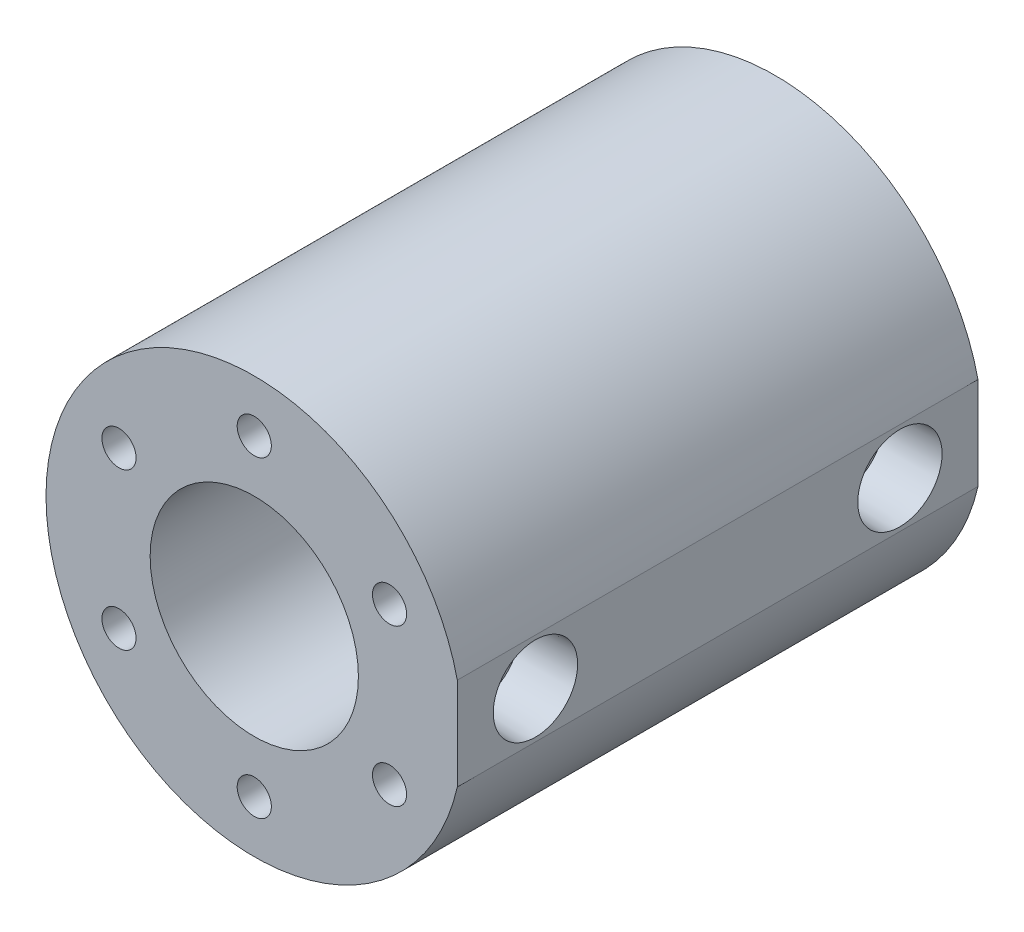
ISO-10303-21;
HEADER;
FILE_DESCRIPTION(('STEP AP214'),'2;1');
FILE_NAME('part.step','',(''),(''),'','','');
FILE_SCHEMA(('AUTOMOTIVE_DESIGN { 1 0 10303 214 1 1 1 1 }'));
ENDSEC;
DATA;
#1=APPLICATION_CONTEXT('core data for automotive mechanical design processes');
#2=APPLICATION_PROTOCOL_DEFINITION('international standard','automotive_design',2000,#1);
#3=PRODUCT_CONTEXT('',#1,'mechanical');
#4=PRODUCT('Part','Part','',(#3));
#5=PRODUCT_RELATED_PRODUCT_CATEGORY('part','',(#4));
#6=PRODUCT_DEFINITION_FORMATION('','',#4);
#7=PRODUCT_DEFINITION_CONTEXT('part definition',#1,'design');
#8=PRODUCT_DEFINITION('design','',#6,#7);
#9=PRODUCT_DEFINITION_SHAPE('','',#8);
#10=(LENGTH_UNIT() NAMED_UNIT(*) SI_UNIT(.MILLI.,.METRE.));
#11=(NAMED_UNIT(*) PLANE_ANGLE_UNIT() SI_UNIT($,.RADIAN.));
#12=(NAMED_UNIT(*) SI_UNIT($,.STERADIAN.) SOLID_ANGLE_UNIT());
#13=UNCERTAINTY_MEASURE_WITH_UNIT(LENGTH_MEASURE(1.E-05),#10,'distance_accuracy_value','');
#14=(GEOMETRIC_REPRESENTATION_CONTEXT(3) GLOBAL_UNCERTAINTY_ASSIGNED_CONTEXT((#13)) GLOBAL_UNIT_ASSIGNED_CONTEXT((#10,
#11,#12)) REPRESENTATION_CONTEXT('',''));
#15=CARTESIAN_POINT('',(0.,0.,0.));
#16=DIRECTION('',(0.,0.,1.));
#17=DIRECTION('',(1.,0.,0.));
#18=AXIS2_PLACEMENT_3D('',#15,#16,#17);
#19=CARTESIAN_POINT('',(0.,0.,31.75));
#20=DIRECTION('',(0.,0.,1.));
#21=DIRECTION('',(1.,0.,0.));
#22=AXIS2_PLACEMENT_3D('',#19,#20,#21);
#23=PLANE('',#22);
#24=CARTESIAN_POINT('',(-16.4977839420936,-9.52499999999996,31.75));
#25=DIRECTION('',(0.,0.,1.));
#26=DIRECTION('',(1.,0.,0.));
#27=AXIS2_PLACEMENT_3D('',#24,#25,#26);
#28=CIRCLE('',#27,2.0828);
#29=CARTESIAN_POINT('',(-14.4149839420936,-9.52499999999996,31.75));
#30=VERTEX_POINT('',#29);
#31=EDGE_CURVE('E189',#30,#30,#28,.T.);
#32=ORIENTED_EDGE('',*,*,#31,.F.);
#33=EDGE_LOOP('',(#32));
#34=FACE_BOUND('',#33,.T.);
#35=CARTESIAN_POINT('',(16.4977839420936,9.52499999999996,31.75));
#36=DIRECTION('',(0.,0.,1.));
#37=DIRECTION('',(1.,0.,0.));
#38=AXIS2_PLACEMENT_3D('',#35,#36,#37);
#39=CIRCLE('',#38,2.0828);
#40=CARTESIAN_POINT('',(18.5805839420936,9.52499999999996,31.75));
#41=VERTEX_POINT('',#40);
#42=EDGE_CURVE('E201',#41,#41,#39,.T.);
#43=ORIENTED_EDGE('',*,*,#42,.F.);
#44=EDGE_LOOP('',(#43));
#45=FACE_BOUND('',#44,.T.);
#46=CARTESIAN_POINT('',(0.,19.05,31.75));
#47=DIRECTION('',(0.,0.,1.));
#48=DIRECTION('',(1.,0.,0.));
#49=AXIS2_PLACEMENT_3D('',#46,#47,#48);
#50=CIRCLE('',#49,2.0828);
#51=CARTESIAN_POINT('',(2.0828,19.05,31.75));
#52=VERTEX_POINT('',#51);
#53=EDGE_CURVE('E213',#52,#52,#50,.T.);
#54=ORIENTED_EDGE('',*,*,#53,.F.);
#55=EDGE_LOOP('',(#54));
#56=FACE_BOUND('',#55,.T.);
#57=CARTESIAN_POINT('',(-16.4977839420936,9.52499999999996,31.75));
#58=DIRECTION('',(0.,0.,1.));
#59=DIRECTION('',(1.,0.,0.));
#60=AXIS2_PLACEMENT_3D('',#57,#58,#59);
#61=CIRCLE('',#60,2.0828);
#62=CARTESIAN_POINT('',(-14.4149839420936,9.52499999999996,31.75));
#63=VERTEX_POINT('',#62);
#64=EDGE_CURVE('E225',#63,#63,#61,.T.);
#65=ORIENTED_EDGE('',*,*,#64,.F.);
#66=EDGE_LOOP('',(#65));
#67=FACE_BOUND('',#66,.T.);
#68=CARTESIAN_POINT('',(0.,-19.05,31.75));
#69=DIRECTION('',(0.,0.,1.));
#70=DIRECTION('',(1.,0.,0.));
#71=AXIS2_PLACEMENT_3D('',#68,#69,#70);
#72=CIRCLE('',#71,2.0828);
#73=CARTESIAN_POINT('',(2.0828,-19.05,31.75));
#74=VERTEX_POINT('',#73);
#75=EDGE_CURVE('E237',#74,#74,#72,.T.);
#76=ORIENTED_EDGE('',*,*,#75,.F.);
#77=EDGE_LOOP('',(#76));
#78=FACE_BOUND('',#77,.T.);
#79=CARTESIAN_POINT('',(16.4977839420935,-9.52500000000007,31.75));
#80=DIRECTION('',(0.,0.,1.));
#81=DIRECTION('',(1.,0.,0.));
#82=AXIS2_PLACEMENT_3D('',#79,#80,#81);
#83=CIRCLE('',#82,2.0828);
#84=CARTESIAN_POINT('',(18.5805839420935,-9.52500000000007,31.75));
#85=VERTEX_POINT('',#84);
#86=EDGE_CURVE('E249',#85,#85,#83,.T.);
#87=ORIENTED_EDGE('',*,*,#86,.F.);
#88=EDGE_LOOP('',(#87));
#89=FACE_BOUND('',#88,.T.);
#90=CARTESIAN_POINT('',(0.,0.,31.75));
#91=DIRECTION('',(0.,0.,1.));
#92=DIRECTION('',(1.,0.,0.));
#93=AXIS2_PLACEMENT_3D('',#90,#91,#92);
#94=CIRCLE('',#93,25.4);
#95=CARTESIAN_POINT('',(24.765,5.64400345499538,31.75));
#96=VERTEX_POINT('',#95);
#97=CARTESIAN_POINT('',(24.765,-5.64400345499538,31.75));
#98=VERTEX_POINT('',#97);
#99=EDGE_CURVE('E263',#96,#98,#94,.T.);
#100=ORIENTED_EDGE('',*,*,#99,.T.);
#101=DIRECTION('',(0.,1.,0.));
#102=VECTOR('',#101,1.);
#103=CARTESIAN_POINT('',(24.765,5.64400345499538,31.75));
#104=LINE('',#103,#102);
#105=EDGE_CURVE('E48',#98,#96,#104,.T.);
#106=ORIENTED_EDGE('',*,*,#105,.T.);
#107=EDGE_LOOP('',(#100,#106));
#108=FACE_BOUND('',#107,.T.);
#109=CARTESIAN_POINT('',(0.,0.,31.75));
#110=DIRECTION('',(0.,0.,1.));
#111=DIRECTION('',(1.,0.,0.));
#112=AXIS2_PLACEMENT_3D('',#109,#110,#111);
#113=CIRCLE('',#112,12.7);
#114=CARTESIAN_POINT('',(12.7,0.,31.75));
#115=VERTEX_POINT('',#114);
#116=EDGE_CURVE('E255',#115,#115,#113,.T.);
#117=ORIENTED_EDGE('',*,*,#116,.F.);
#118=EDGE_LOOP('',(#117));
#119=FACE_BOUND('',#118,.T.);
#120=ADVANCED_FACE('F34',(#34,#45,#56,#67,#78,#89,#108,#119),#23,.T.);
#121=CARTESIAN_POINT('',(0.,0.,-31.75));
#122=DIRECTION('',(0.,0.,1.));
#123=DIRECTION('',(1.,0.,0.));
#124=AXIS2_PLACEMENT_3D('',#121,#122,#123);
#125=PLANE('',#124);
#126=CARTESIAN_POINT('',(-16.4977839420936,-9.52499999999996,-31.75));
#127=DIRECTION('',(0.,0.,-1.));
#128=DIRECTION('',(-1.,0.,0.));
#129=AXIS2_PLACEMENT_3D('',#126,#127,#128);
#130=CIRCLE('',#129,2.0828);
#131=CARTESIAN_POINT('',(-18.5805839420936,-9.52499999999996,-31.75));
#132=VERTEX_POINT('',#131);
#133=EDGE_CURVE('E117',#132,#132,#130,.T.);
#134=ORIENTED_EDGE('',*,*,#133,.F.);
#135=EDGE_LOOP('',(#134));
#136=FACE_BOUND('',#135,.T.);
#137=CARTESIAN_POINT('',(16.4977839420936,9.52499999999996,-31.75));
#138=DIRECTION('',(0.,0.,-1.));
#139=DIRECTION('',(-1.,0.,0.));
#140=AXIS2_PLACEMENT_3D('',#137,#138,#139);
#141=CIRCLE('',#140,2.0828);
#142=CARTESIAN_POINT('',(14.4149839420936,9.52499999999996,-31.75));
#143=VERTEX_POINT('',#142);
#144=EDGE_CURVE('E129',#143,#143,#141,.T.);
#145=ORIENTED_EDGE('',*,*,#144,.F.);
#146=EDGE_LOOP('',(#145));
#147=FACE_BOUND('',#146,.T.);
#148=CARTESIAN_POINT('',(0.,19.05,-31.75));
#149=DIRECTION('',(0.,0.,-1.));
#150=DIRECTION('',(-1.,0.,0.));
#151=AXIS2_PLACEMENT_3D('',#148,#149,#150);
#152=CIRCLE('',#151,2.0828);
#153=CARTESIAN_POINT('',(-2.0828,19.05,-31.75));
#154=VERTEX_POINT('',#153);
#155=EDGE_CURVE('E141',#154,#154,#152,.T.);
#156=ORIENTED_EDGE('',*,*,#155,.F.);
#157=EDGE_LOOP('',(#156));
#158=FACE_BOUND('',#157,.T.);
#159=CARTESIAN_POINT('',(-16.4977839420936,9.52499999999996,-31.75));
#160=DIRECTION('',(0.,0.,-1.));
#161=DIRECTION('',(-1.,0.,0.));
#162=AXIS2_PLACEMENT_3D('',#159,#160,#161);
#163=CIRCLE('',#162,2.0828);
#164=CARTESIAN_POINT('',(-18.5805839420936,9.52499999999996,-31.75));
#165=VERTEX_POINT('',#164);
#166=EDGE_CURVE('E153',#165,#165,#163,.T.);
#167=ORIENTED_EDGE('',*,*,#166,.F.);
#168=EDGE_LOOP('',(#167));
#169=FACE_BOUND('',#168,.T.);
#170=CARTESIAN_POINT('',(0.,-19.05,-31.75));
#171=DIRECTION('',(0.,0.,-1.));
#172=DIRECTION('',(-1.,0.,0.));
#173=AXIS2_PLACEMENT_3D('',#170,#171,#172);
#174=CIRCLE('',#173,2.0828);
#175=CARTESIAN_POINT('',(-2.0828,-19.05,-31.75));
#176=VERTEX_POINT('',#175);
#177=EDGE_CURVE('E165',#176,#176,#174,.T.);
#178=ORIENTED_EDGE('',*,*,#177,.F.);
#179=EDGE_LOOP('',(#178));
#180=FACE_BOUND('',#179,.T.);
#181=CARTESIAN_POINT('',(16.4977839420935,-9.52500000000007,-31.75));
#182=DIRECTION('',(0.,0.,-1.));
#183=DIRECTION('',(-1.,0.,0.));
#184=AXIS2_PLACEMENT_3D('',#181,#182,#183);
#185=CIRCLE('',#184,2.0828);
#186=CARTESIAN_POINT('',(14.4149839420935,-9.52500000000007,-31.75));
#187=VERTEX_POINT('',#186);
#188=EDGE_CURVE('E177',#187,#187,#185,.T.);
#189=ORIENTED_EDGE('',*,*,#188,.F.);
#190=EDGE_LOOP('',(#189));
#191=FACE_BOUND('',#190,.T.);
#192=CARTESIAN_POINT('',(0.,0.,-31.75));
#193=DIRECTION('',(0.,0.,1.));
#194=DIRECTION('',(1.,0.,0.));
#195=AXIS2_PLACEMENT_3D('',#192,#193,#194);
#196=CIRCLE('',#195,25.4);
#197=CARTESIAN_POINT('',(24.765,5.64400345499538,-31.75));
#198=VERTEX_POINT('',#197);
#199=CARTESIAN_POINT('',(24.765,-5.64400345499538,-31.75));
#200=VERTEX_POINT('',#199);
#201=EDGE_CURVE('E258',#198,#200,#196,.T.);
#202=ORIENTED_EDGE('',*,*,#201,.F.);
#203=DIRECTION('',(0.,1.,0.));
#204=VECTOR('',#203,1.);
#205=CARTESIAN_POINT('',(24.765,5.64400345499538,-31.75));
#206=LINE('',#205,#204);
#207=EDGE_CURVE('E261',#200,#198,#206,.T.);
#208=ORIENTED_EDGE('',*,*,#207,.F.);
#209=EDGE_LOOP('',(#202,#208));
#210=FACE_BOUND('',#209,.T.);
#211=CARTESIAN_POINT('',(0.,0.,-31.75));
#212=DIRECTION('',(0.,0.,1.));
#213=DIRECTION('',(1.,0.,0.));
#214=AXIS2_PLACEMENT_3D('',#211,#212,#213);
#215=CIRCLE('',#214,12.7);
#216=CARTESIAN_POINT('',(12.7,0.,-31.75));
#217=VERTEX_POINT('',#216);
#218=EDGE_CURVE('E252',#217,#217,#215,.T.);
#219=ORIENTED_EDGE('',*,*,#218,.T.);
#220=EDGE_LOOP('',(#219));
#221=FACE_BOUND('',#220,.T.);
#222=ADVANCED_FACE('F271',(#136,#147,#158,#169,#180,#191,#210,#221),#125,.F.);
#223=CARTESIAN_POINT('',(0.,0.,31.75));
#224=DIRECTION('',(0.,0.,-1.));
#225=DIRECTION('',(-1.,0.,0.));
#226=AXIS2_PLACEMENT_3D('',#223,#224,#225);
#227=CYLINDRICAL_SURFACE('',#226,25.4);
#228=ORIENTED_EDGE('',*,*,#201,.T.);
#229=DIRECTION('',(0.,0.,-1.));
#230=VECTOR('',#229,1.);
#231=CARTESIAN_POINT('',(24.765,-5.64400345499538,31.75));
#232=LINE('',#231,#230);
#233=EDGE_CURVE('E11',#98,#200,#232,.T.);
#234=ORIENTED_EDGE('',*,*,#233,.F.);
#235=ORIENTED_EDGE('',*,*,#99,.F.);
#236=DIRECTION('',(0.,0.,-1.));
#237=VECTOR('',#236,1.);
#238=CARTESIAN_POINT('',(24.765,5.64400345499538,31.75));
#239=LINE('',#238,#237);
#240=EDGE_CURVE('E42',#96,#198,#239,.T.);
#241=ORIENTED_EDGE('',*,*,#240,.T.);
#242=EDGE_LOOP('',(#228,#234,#235,#241));
#243=FACE_BOUND('',#242,.T.);
#244=ADVANCED_FACE('F36',(#243),#227,.T.);
#245=CARTESIAN_POINT('',(24.765,5.64400345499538,31.75));
#246=DIRECTION('',(-1.,0.,0.));
#247=DIRECTION('',(0.,0.,1.));
#248=AXIS2_PLACEMENT_3D('',#245,#246,#247);
#249=PLANE('',#248);
#250=CARTESIAN_POINT('',(24.765,0.,-22.225));
#251=DIRECTION('',(1.,0.,0.));
#252=DIRECTION('',(0.,0.,-1.));
#253=AXIS2_PLACEMENT_3D('',#250,#251,#252);
#254=CIRCLE('',#253,5.1435);
#255=CARTESIAN_POINT('',(24.765,0.,-27.3685));
#256=VERTEX_POINT('',#255);
#257=EDGE_CURVE('E531',#256,#256,#254,.T.);
#258=ORIENTED_EDGE('',*,*,#257,.F.);
#259=EDGE_LOOP('',(#258));
#260=FACE_BOUND('',#259,.T.);
#261=CARTESIAN_POINT('',(24.765,0.,22.225));
#262=DIRECTION('',(1.,0.,0.));
#263=DIRECTION('',(0.,0.,-1.));
#264=AXIS2_PLACEMENT_3D('',#261,#262,#263);
#265=CIRCLE('',#264,5.1435);
#266=CARTESIAN_POINT('',(24.765,0.,17.0815));
#267=VERTEX_POINT('',#266);
#268=EDGE_CURVE('E543',#267,#267,#265,.T.);
#269=ORIENTED_EDGE('',*,*,#268,.F.);
#270=EDGE_LOOP('',(#269));
#271=FACE_BOUND('',#270,.T.);
#272=ORIENTED_EDGE('',*,*,#207,.T.);
#273=ORIENTED_EDGE('',*,*,#240,.F.);
#274=ORIENTED_EDGE('',*,*,#105,.F.);
#275=ORIENTED_EDGE('',*,*,#233,.T.);
#276=EDGE_LOOP('',(#272,#273,#274,#275));
#277=FACE_BOUND('',#276,.T.);
#278=ADVANCED_FACE('F273',(#260,#271,#277),#249,.F.);
#279=CARTESIAN_POINT('',(0.,0.,31.75));
#280=DIRECTION('',(0.,0.,-1.));
#281=DIRECTION('',(-1.,0.,0.));
#282=AXIS2_PLACEMENT_3D('',#279,#280,#281);
#283=CYLINDRICAL_SURFACE('',#282,12.7);
#284=CARTESIAN_POINT('',(12.7,0.,19.05));
#285=CARTESIAN_POINT('',(12.6999970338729,0.175421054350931,19.0500049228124));
#286=CARTESIAN_POINT('',(12.6963292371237,0.350897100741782,19.0645871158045));
#287=CARTESIAN_POINT('',(12.6820530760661,0.696820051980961,19.1224432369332));
#288=CARTESIAN_POINT('',(12.6714407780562,0.867264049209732,19.1657334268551));
#289=CARTESIAN_POINT('',(12.6444507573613,1.19807751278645,19.2795297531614));
#290=CARTESIAN_POINT('',(12.6280799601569,1.35845880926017,19.3500032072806));
#291=CARTESIAN_POINT('',(12.591316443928,1.66512267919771,19.5160506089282));
#292=CARTESIAN_POINT('',(12.5709235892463,1.81140477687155,19.6116254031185));
#293=CARTESIAN_POINT('',(12.5278602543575,2.08873074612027,19.8272416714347));
#294=CARTESIAN_POINT('',(12.5051546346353,2.2194428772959,19.9477028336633));
#295=CARTESIAN_POINT('',(12.4602582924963,2.45903522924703,20.2087738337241));
#296=CARTESIAN_POINT('',(12.4380676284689,2.56791298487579,20.349385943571));
#297=CARTESIAN_POINT('',(12.3963594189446,2.76230618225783,20.6493432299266));
#298=CARTESIAN_POINT('',(12.3768864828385,2.84745052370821,20.8089356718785));
#299=CARTESIAN_POINT('',(12.343330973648,2.98957345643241,21.1407341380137));
#300=CARTESIAN_POINT('',(12.3292475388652,3.04655655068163,21.3129381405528));
#301=CARTESIAN_POINT('',(12.3084267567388,3.12960773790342,21.6614237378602));
#302=CARTESIAN_POINT('',(12.3015478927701,3.15627230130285,21.8375545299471));
#303=CARTESIAN_POINT('',(12.2954915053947,3.17978742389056,22.1919134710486));
#304=CARTESIAN_POINT('',(12.2963127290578,3.176642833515,22.3701412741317));
#305=CARTESIAN_POINT('',(12.3054365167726,3.14110481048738,22.7190634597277));
#306=CARTESIAN_POINT('',(12.3135572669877,3.10942215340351,22.8898357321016));
#307=CARTESIAN_POINT('',(12.3360753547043,3.01884119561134,23.2235608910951));
#308=CARTESIAN_POINT('',(12.3504731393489,2.95994095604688,23.3865132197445));
#309=CARTESIAN_POINT('',(12.3840899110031,2.81599106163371,23.701878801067));
#310=CARTESIAN_POINT('',(12.4033560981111,2.73068344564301,23.8541690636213));
#311=CARTESIAN_POINT('',(12.4445122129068,2.53652078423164,24.1425279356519));
#312=CARTESIAN_POINT('',(12.4664025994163,2.42766161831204,24.2785937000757));
#313=CARTESIAN_POINT('',(12.5111061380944,2.18580424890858,24.5347143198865));
#314=CARTESIAN_POINT('',(12.533927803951,2.05220624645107,24.6542020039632));
#315=CARTESIAN_POINT('',(12.5773596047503,1.76659522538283,24.8691849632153));
#316=CARTESIAN_POINT('',(12.5979696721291,1.61458164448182,24.9646795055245));
#317=CARTESIAN_POINT('',(12.6347586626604,1.29564529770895,25.1291737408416));
#318=CARTESIAN_POINT('',(12.6509221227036,1.12867311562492,25.1980813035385));
#319=CARTESIAN_POINT('',(12.676884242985,0.785020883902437,25.3066916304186));
#320=CARTESIAN_POINT('',(12.6866841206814,0.60834269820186,25.3463999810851));
#321=CARTESIAN_POINT('',(12.6986347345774,0.255142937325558,25.3946185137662));
#322=CARTESIAN_POINT('',(12.7009747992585,0.0787330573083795,25.4039010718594));
#323=CARTESIAN_POINT('',(12.6982813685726,-0.273119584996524,25.3931229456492));
#324=CARTESIAN_POINT('',(12.6932485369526,-0.448562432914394,25.3730649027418));
#325=CARTESIAN_POINT('',(12.6764961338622,-0.790816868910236,25.3048115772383));
#326=CARTESIAN_POINT('',(12.6648767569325,-0.957717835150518,25.2570376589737));
#327=CARTESIAN_POINT('',(12.6362609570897,-1.28112793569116,25.1351900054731));
#328=CARTESIAN_POINT('',(12.6192639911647,-1.43763601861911,25.0611136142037));
#329=CARTESIAN_POINT('',(12.5813250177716,-1.73889063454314,24.8872668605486));
#330=CARTESIAN_POINT('',(12.5603183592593,-1.88337918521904,24.7870638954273));
#331=CARTESIAN_POINT('',(12.5167921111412,-2.15376466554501,24.5643613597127));
#332=CARTESIAN_POINT('',(12.4942722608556,-2.27965837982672,24.4418579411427));
#333=CARTESIAN_POINT('',(12.4495762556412,-2.51246336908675,24.1744458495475));
#334=CARTESIAN_POINT('',(12.4274221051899,-2.6188328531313,24.0290610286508));
#335=CARTESIAN_POINT('',(12.3865825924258,-2.80566443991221,23.7220492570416));
#336=CARTESIAN_POINT('',(12.3678970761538,-2.88612769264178,23.560423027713));
#337=CARTESIAN_POINT('',(12.3363163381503,-3.01826384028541,23.226382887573));
#338=CARTESIAN_POINT('',(12.3233869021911,-3.07010730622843,23.054039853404));
#339=CARTESIAN_POINT('',(12.3047494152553,-3.14398164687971,22.7027112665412));
#340=CARTESIAN_POINT('',(12.299039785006,-3.16601904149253,22.5237271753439));
#341=CARTESIAN_POINT('',(12.2956087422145,-3.17931501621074,22.1697104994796));
#342=CARTESIAN_POINT('',(12.2976625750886,-3.17143955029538,21.9947120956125));
#343=CARTESIAN_POINT('',(12.3090074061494,-3.1271152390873,21.6486234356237));
#344=CARTESIAN_POINT('',(12.3182982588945,-3.09066696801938,21.4775331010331));
#345=CARTESIAN_POINT('',(12.3429450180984,-2.99070462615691,21.1450587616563));
#346=CARTESIAN_POINT('',(12.3582644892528,-2.92735297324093,20.9836230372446));
#347=CARTESIAN_POINT('',(12.3932474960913,-2.7755107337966,20.6735566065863));
#348=CARTESIAN_POINT('',(12.4129116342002,-2.68701666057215,20.5249276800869));
#349=CARTESIAN_POINT('',(12.4550092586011,-2.48468673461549,20.2405093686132));
#350=CARTESIAN_POINT('',(12.4775016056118,-2.37025002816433,20.1051560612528));
#351=CARTESIAN_POINT('',(12.5223699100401,-2.12045416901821,19.8552920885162));
#352=CARTESIAN_POINT('',(12.5447458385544,-1.98509005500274,19.7407863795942));
#353=CARTESIAN_POINT('',(12.5873437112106,-1.6943230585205,19.5338460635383));
#354=CARTESIAN_POINT('',(12.6075193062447,-1.53860166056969,19.4418487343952));
#355=CARTESIAN_POINT('',(12.6429542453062,-1.21341315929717,19.2854845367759));
#356=CARTESIAN_POINT('',(12.6582171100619,-1.04395600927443,19.2210978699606));
#357=CARTESIAN_POINT('',(12.6798505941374,-0.729001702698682,19.1313396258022));
#358=CARTESIAN_POINT('',(12.6873547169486,-0.585004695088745,19.1009032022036));
#359=CARTESIAN_POINT('',(12.6974304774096,-0.294017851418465,19.0602320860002));
#360=CARTESIAN_POINT('',(12.7000024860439,-0.147028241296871,19.0499958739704));
#361=CARTESIAN_POINT('',(12.7,0.,19.05));
#362=B_SPLINE_CURVE_WITH_KNOTS('',3,(#284,#285,#286,#287,#288,#289,#290,#291,#292,#293,#294,
#295,#296,#297,#298,#299,#300,#301,#302,#303,#304,#305,#306,#307,#308,#309,#310,#311,#312,#313,
#314,#315,#316,#317,#318,#319,#320,#321,#322,#323,#324,#325,#326,#327,#328,#329,#330,#331,#332,
#333,#334,#335,#336,#337,#338,#339,#340,#341,#342,#343,#344,#345,#346,#347,#348,#349,#350,#351,
#352,#353,#354,#355,#356,#357,#358,#359,#360,#361),.UNSPECIFIED.,.T.,.F.,(4,2,2,2,2,2,2,2,2,2,2,
2,2,2,2,2,2,2,2,2,2,2,2,2,2,2,2,2,2,2,2,2,2,2,2,2,2,2,4),(0.,0.525724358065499,1.05174676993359,
1.57713870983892,2.10254837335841,2.63767221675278,3.17285644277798,3.71599137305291,
4.25903942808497,4.79120824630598,5.3232904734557,5.84247618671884,6.36169889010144,
6.8861628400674,7.41071862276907,7.9502317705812,8.48976139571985,9.0311441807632,
9.57242335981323,10.09985087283,10.6272309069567,11.1467958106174,11.6664131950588,
12.1952509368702,12.7241800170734,13.266092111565,13.8079801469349,14.34660272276,
14.8851074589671,15.4081433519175,15.9311687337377,16.4510804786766,16.9710643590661,
17.5046127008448,18.0382877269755,18.5816279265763,19.1245778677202,19.5652441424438,
20.005877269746),.UNSPECIFIED.);
#363=CARTESIAN_POINT('',(12.7,0.,19.05));
#364=VERTEX_POINT('',#363);
#365=EDGE_CURVE('E565',#364,#364,#362,.T.);
#366=ORIENTED_EDGE('',*,*,#365,.T.);
#367=EDGE_LOOP('',(#366));
#368=FACE_BOUND('',#367,.T.);
#369=CARTESIAN_POINT('',(12.7,0.,-25.4));
#370=CARTESIAN_POINT('',(12.6999970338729,0.175421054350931,-25.3999950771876));
#371=CARTESIAN_POINT('',(12.6963292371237,0.350897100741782,-25.3854128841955));
#372=CARTESIAN_POINT('',(12.6820530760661,0.696820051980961,-25.3275567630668));
#373=CARTESIAN_POINT('',(12.6714407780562,0.867264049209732,-25.2842665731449));
#374=CARTESIAN_POINT('',(12.6444507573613,1.19807751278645,-25.1704702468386));
#375=CARTESIAN_POINT('',(12.6280799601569,1.35845880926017,-25.0999967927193));
#376=CARTESIAN_POINT('',(12.591316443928,1.66512267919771,-24.9339493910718));
#377=CARTESIAN_POINT('',(12.5709235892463,1.81140477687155,-24.8383745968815));
#378=CARTESIAN_POINT('',(12.5278602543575,2.08873074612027,-24.6227583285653));
#379=CARTESIAN_POINT('',(12.5051546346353,2.2194428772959,-24.5022971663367));
#380=CARTESIAN_POINT('',(12.4602582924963,2.45903522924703,-24.2412261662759));
#381=CARTESIAN_POINT('',(12.4380676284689,2.56791298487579,-24.100614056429));
#382=CARTESIAN_POINT('',(12.3963594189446,2.76230618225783,-23.8006567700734));
#383=CARTESIAN_POINT('',(12.3768864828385,2.84745052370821,-23.6410643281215));
#384=CARTESIAN_POINT('',(12.343330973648,2.98957345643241,-23.3092658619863));
#385=CARTESIAN_POINT('',(12.3292475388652,3.04655655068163,-23.1370618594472));
#386=CARTESIAN_POINT('',(12.3084267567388,3.12960773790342,-22.7885762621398));
#387=CARTESIAN_POINT('',(12.3015478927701,3.15627230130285,-22.6124454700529));
#388=CARTESIAN_POINT('',(12.2954915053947,3.17978742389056,-22.2580865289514));
#389=CARTESIAN_POINT('',(12.2963127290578,3.176642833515,-22.0798587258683));
#390=CARTESIAN_POINT('',(12.3054365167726,3.14110481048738,-21.7309365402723));
#391=CARTESIAN_POINT('',(12.3135572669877,3.10942215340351,-21.5601642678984));
#392=CARTESIAN_POINT('',(12.3360753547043,3.01884119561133,-21.2264391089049));
#393=CARTESIAN_POINT('',(12.3504731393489,2.95994095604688,-21.0634867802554));
#394=CARTESIAN_POINT('',(12.3840899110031,2.81599106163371,-20.748121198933));
#395=CARTESIAN_POINT('',(12.4033560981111,2.73068344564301,-20.5958309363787));
#396=CARTESIAN_POINT('',(12.4445122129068,2.53652078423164,-20.3074720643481));
#397=CARTESIAN_POINT('',(12.4664025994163,2.42766161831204,-20.1714062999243));
#398=CARTESIAN_POINT('',(12.5111061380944,2.18580424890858,-19.9152856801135));
#399=CARTESIAN_POINT('',(12.533927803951,2.05220624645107,-19.7957979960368));
#400=CARTESIAN_POINT('',(12.5773596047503,1.76659522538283,-19.5808150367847));
#401=CARTESIAN_POINT('',(12.5979696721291,1.61458164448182,-19.4853204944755));
#402=CARTESIAN_POINT('',(12.6347586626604,1.29564529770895,-19.3208262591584));
#403=CARTESIAN_POINT('',(12.6509221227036,1.12867311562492,-19.2519186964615));
#404=CARTESIAN_POINT('',(12.676884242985,0.785020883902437,-19.1433083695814));
#405=CARTESIAN_POINT('',(12.6866841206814,0.60834269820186,-19.1036000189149));
#406=CARTESIAN_POINT('',(12.6986347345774,0.255142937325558,-19.0553814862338));
#407=CARTESIAN_POINT('',(12.7009747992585,0.0787330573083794,-19.0460989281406));
#408=CARTESIAN_POINT('',(12.6982813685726,-0.273119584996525,-19.0568770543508));
#409=CARTESIAN_POINT('',(12.6932485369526,-0.448562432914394,-19.0769350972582));
#410=CARTESIAN_POINT('',(12.6764961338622,-0.790816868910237,-19.1451884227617));
#411=CARTESIAN_POINT('',(12.6648767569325,-0.95771783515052,-19.1929623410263));
#412=CARTESIAN_POINT('',(12.6362609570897,-1.28112793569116,-19.3148099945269));
#413=CARTESIAN_POINT('',(12.6192639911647,-1.43763601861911,-19.3888863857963));
#414=CARTESIAN_POINT('',(12.5813250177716,-1.73889063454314,-19.5627331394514));
#415=CARTESIAN_POINT('',(12.5603183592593,-1.88337918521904,-19.6629361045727));
#416=CARTESIAN_POINT('',(12.5167921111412,-2.15376466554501,-19.8856386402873));
#417=CARTESIAN_POINT('',(12.4942722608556,-2.27965837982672,-20.0081420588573));
#418=CARTESIAN_POINT('',(12.4495762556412,-2.51246336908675,-20.2755541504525));
#419=CARTESIAN_POINT('',(12.4274221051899,-2.6188328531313,-20.4209389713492));
#420=CARTESIAN_POINT('',(12.3865825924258,-2.80566443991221,-20.7279507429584));
#421=CARTESIAN_POINT('',(12.3678970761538,-2.88612769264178,-20.889576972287));
#422=CARTESIAN_POINT('',(12.3363163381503,-3.01826384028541,-21.223617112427));
#423=CARTESIAN_POINT('',(12.3233869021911,-3.07010730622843,-21.395960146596));
#424=CARTESIAN_POINT('',(12.3047494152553,-3.14398164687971,-21.7472887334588));
#425=CARTESIAN_POINT('',(12.299039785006,-3.16601904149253,-21.9262728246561));
#426=CARTESIAN_POINT('',(12.2956087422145,-3.17931501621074,-22.2802895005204));
#427=CARTESIAN_POINT('',(12.2976625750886,-3.17143955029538,-22.4552879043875));
#428=CARTESIAN_POINT('',(12.3090074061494,-3.1271152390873,-22.8013765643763));
#429=CARTESIAN_POINT('',(12.3182982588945,-3.09066696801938,-22.9724668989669));
#430=CARTESIAN_POINT('',(12.3429450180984,-2.99070462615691,-23.3049412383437));
#431=CARTESIAN_POINT('',(12.3582644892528,-2.92735297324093,-23.4663769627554));
#432=CARTESIAN_POINT('',(12.3932474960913,-2.7755107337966,-23.7764433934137));
#433=CARTESIAN_POINT('',(12.4129116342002,-2.68701666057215,-23.9250723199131));
#434=CARTESIAN_POINT('',(12.4550092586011,-2.48468673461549,-24.2094906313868));
#435=CARTESIAN_POINT('',(12.4775016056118,-2.37025002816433,-24.3448439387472));
#436=CARTESIAN_POINT('',(12.5223699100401,-2.12045416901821,-24.5947079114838));
#437=CARTESIAN_POINT('',(12.5447458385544,-1.98509005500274,-24.7092136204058));
#438=CARTESIAN_POINT('',(12.5873437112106,-1.6943230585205,-24.9161539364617));
#439=CARTESIAN_POINT('',(12.6075193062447,-1.53860166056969,-25.0081512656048));
#440=CARTESIAN_POINT('',(12.6429542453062,-1.21341315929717,-25.1645154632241));
#441=CARTESIAN_POINT('',(12.6582171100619,-1.04395600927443,-25.2289021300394));
#442=CARTESIAN_POINT('',(12.6798505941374,-0.729001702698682,-25.3186603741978));
#443=CARTESIAN_POINT('',(12.6873547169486,-0.585004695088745,-25.3490967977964));
#444=CARTESIAN_POINT('',(12.6974304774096,-0.294017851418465,-25.3897679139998));
#445=CARTESIAN_POINT('',(12.7000024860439,-0.147028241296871,-25.4000041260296));
#446=CARTESIAN_POINT('',(12.7,0.,-25.4));
#447=B_SPLINE_CURVE_WITH_KNOTS('',3,(#369,#370,#371,#372,#373,#374,#375,#376,#377,#378,#379,
#380,#381,#382,#383,#384,#385,#386,#387,#388,#389,#390,#391,#392,#393,#394,#395,#396,#397,#398,
#399,#400,#401,#402,#403,#404,#405,#406,#407,#408,#409,#410,#411,#412,#413,#414,#415,#416,#417,
#418,#419,#420,#421,#422,#423,#424,#425,#426,#427,#428,#429,#430,#431,#432,#433,#434,#435,#436,
#437,#438,#439,#440,#441,#442,#443,#444,#445,#446),.UNSPECIFIED.,.T.,.F.,(4,2,2,2,2,2,2,2,2,2,2,
2,2,2,2,2,2,2,2,2,2,2,2,2,2,2,2,2,2,2,2,2,2,2,2,2,2,2,4),(0.,0.525724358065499,1.05174676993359,
1.57713870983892,2.10254837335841,2.63767221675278,3.17285644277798,3.71599137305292,
4.25903942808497,4.79120824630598,5.3232904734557,5.84247618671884,6.36169889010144,
6.8861628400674,7.41071862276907,7.9502317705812,8.48976139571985,9.0311441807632,
9.57242335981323,10.09985087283,10.6272309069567,11.1467958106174,11.6664131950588,
12.1952509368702,12.7241800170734,13.266092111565,13.8079801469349,14.34660272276,
14.8851074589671,15.4081433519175,15.9311687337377,16.4510804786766,16.9710643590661,
17.5046127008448,18.0382877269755,18.5816279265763,19.1245778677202,19.5652441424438,
20.005877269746),.UNSPECIFIED.);
#448=CARTESIAN_POINT('',(12.7,0.,-25.4));
#449=VERTEX_POINT('',#448);
#450=EDGE_CURVE('E522',#449,#449,#447,.T.);
#451=ORIENTED_EDGE('',*,*,#450,.T.);
#452=EDGE_LOOP('',(#451));
#453=FACE_BOUND('',#452,.T.);
#454=ORIENTED_EDGE('',*,*,#116,.T.);
#455=EDGE_LOOP('',(#454));
#456=FACE_BOUND('',#455,.T.);
#457=ORIENTED_EDGE('',*,*,#218,.F.);
#458=EDGE_LOOP('',(#457));
#459=FACE_BOUND('',#458,.T.);
#460=ADVANCED_FACE('F275',(#368,#453,#456,#459),#283,.F.);
#461=CARTESIAN_POINT('',(16.4977839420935,-9.52500000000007,31.75));
#462=DIRECTION('',(0.,0.,1.));
#463=DIRECTION('',(1.,0.,0.));
#464=AXIS2_PLACEMENT_3D('',#461,#462,#463);
#465=CYLINDRICAL_SURFACE('',#464,2.0828);
#466=CARTESIAN_POINT('',(16.4977839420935,-9.52500000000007,13.97));
#467=DIRECTION('',(0.,0.,1.));
#468=DIRECTION('',(1.,0.,0.));
#469=AXIS2_PLACEMENT_3D('',#466,#467,#468);
#470=CIRCLE('',#469,2.0828);
#471=CARTESIAN_POINT('',(18.5805839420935,-9.52500000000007,13.97));
#472=VERTEX_POINT('',#471);
#473=EDGE_CURVE('E246',#472,#472,#470,.T.);
#474=ORIENTED_EDGE('',*,*,#473,.F.);
#475=EDGE_LOOP('',(#474));
#476=FACE_BOUND('',#475,.T.);
#477=ORIENTED_EDGE('',*,*,#86,.T.);
#478=EDGE_LOOP('',(#477));
#479=FACE_BOUND('',#478,.T.);
#480=ADVANCED_FACE('F281',(#476,#479),#465,.F.);
#481=CARTESIAN_POINT('',(18.2249839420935,-9.52500000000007,13.97));
#482=DIRECTION('',(0.,0.,-1.));
#483=DIRECTION('',(-1.,0.,0.));
#484=AXIS2_PLACEMENT_3D('',#481,#482,#483);
#485=PLANE('',#484);
#486=CARTESIAN_POINT('',(16.4977839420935,-9.52500000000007,13.97));
#487=DIRECTION('',(0.,0.,1.));
#488=DIRECTION('',(1.,0.,0.));
#489=AXIS2_PLACEMENT_3D('',#486,#487,#488);
#490=CIRCLE('',#489,1.72719999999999);
#491=CARTESIAN_POINT('',(18.2249839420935,-9.52500000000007,13.97));
#492=VERTEX_POINT('',#491);
#493=EDGE_CURVE('E243',#492,#492,#490,.T.);
#494=ORIENTED_EDGE('',*,*,#493,.F.);
#495=EDGE_LOOP('',(#494));
#496=FACE_BOUND('',#495,.T.);
#497=ORIENTED_EDGE('',*,*,#473,.T.);
#498=EDGE_LOOP('',(#497));
#499=FACE_BOUND('',#498,.T.);
#500=ADVANCED_FACE('F299',(#496,#499),#485,.F.);
#501=CARTESIAN_POINT('',(16.4977839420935,-9.52500000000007,31.75));
#502=DIRECTION('',(0.,0.,1.));
#503=DIRECTION('',(1.,0.,0.));
#504=AXIS2_PLACEMENT_3D('',#501,#502,#503);
#505=CYLINDRICAL_SURFACE('',#504,1.72719999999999);
#506=CARTESIAN_POINT('',(16.4977839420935,-9.52500000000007,11.5824));
#507=DIRECTION('',(0.,0.,1.));
#508=DIRECTION('',(1.,0.,0.));
#509=AXIS2_PLACEMENT_3D('',#506,#507,#508);
#510=CIRCLE('',#509,1.72719999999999);
#511=CARTESIAN_POINT('',(18.2249839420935,-9.52500000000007,11.5824));
#512=VERTEX_POINT('',#511);
#513=EDGE_CURVE('E240',#512,#512,#510,.T.);
#514=ORIENTED_EDGE('',*,*,#513,.F.);
#515=EDGE_LOOP('',(#514));
#516=FACE_BOUND('',#515,.T.);
#517=ORIENTED_EDGE('',*,*,#493,.T.);
#518=EDGE_LOOP('',(#517));
#519=FACE_BOUND('',#518,.T.);
#520=ADVANCED_FACE('F303',(#516,#519),#505,.F.);
#521=CARTESIAN_POINT('',(16.4977839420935,-9.52500000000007,11.5824));
#522=DIRECTION('',(0.,0.,1.));
#523=DIRECTION('',(1.,0.,0.));
#524=AXIS2_PLACEMENT_3D('',#521,#522,#523);
#525=CONICAL_SURFACE('',#524,1.72719999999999,1.02974425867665);
#526=CARTESIAN_POINT('',(16.4977839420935,-9.52500000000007,10.5445935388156));
#527=VERTEX_POINT('',#526);
#528=VERTEX_LOOP('',#527);
#529=FACE_BOUND('',#528,.T.);
#530=ORIENTED_EDGE('',*,*,#513,.T.);
#531=EDGE_LOOP('',(#530));
#532=FACE_BOUND('',#531,.T.);
#533=ADVANCED_FACE('F307',(#529,#532),#525,.F.);
#534=CARTESIAN_POINT('',(0.,-19.05,31.75));
#535=DIRECTION('',(0.,0.,1.));
#536=DIRECTION('',(1.,0.,0.));
#537=AXIS2_PLACEMENT_3D('',#534,#535,#536);
#538=CYLINDRICAL_SURFACE('',#537,2.0828);
#539=CARTESIAN_POINT('',(0.,-19.05,13.97));
#540=DIRECTION('',(0.,0.,1.));
#541=DIRECTION('',(1.,0.,0.));
#542=AXIS2_PLACEMENT_3D('',#539,#540,#541);
#543=CIRCLE('',#542,2.0828);
#544=CARTESIAN_POINT('',(2.0828,-19.05,13.97));
#545=VERTEX_POINT('',#544);
#546=EDGE_CURVE('E234',#545,#545,#543,.T.);
#547=ORIENTED_EDGE('',*,*,#546,.F.);
#548=EDGE_LOOP('',(#547));
#549=FACE_BOUND('',#548,.T.);
#550=ORIENTED_EDGE('',*,*,#75,.T.);
#551=EDGE_LOOP('',(#550));
#552=FACE_BOUND('',#551,.T.);
#553=ADVANCED_FACE('F311',(#549,#552),#538,.F.);
#554=CARTESIAN_POINT('',(1.7272,-19.05,13.97));
#555=DIRECTION('',(0.,0.,-1.));
#556=DIRECTION('',(-1.,0.,0.));
#557=AXIS2_PLACEMENT_3D('',#554,#555,#556);
#558=PLANE('',#557);
#559=CARTESIAN_POINT('',(0.,-19.05,13.97));
#560=DIRECTION('',(0.,0.,1.));
#561=DIRECTION('',(1.,0.,0.));
#562=AXIS2_PLACEMENT_3D('',#559,#560,#561);
#563=CIRCLE('',#562,1.7272);
#564=CARTESIAN_POINT('',(1.7272,-19.05,13.97));
#565=VERTEX_POINT('',#564);
#566=EDGE_CURVE('E231',#565,#565,#563,.T.);
#567=ORIENTED_EDGE('',*,*,#566,.F.);
#568=EDGE_LOOP('',(#567));
#569=FACE_BOUND('',#568,.T.);
#570=ORIENTED_EDGE('',*,*,#546,.T.);
#571=EDGE_LOOP('',(#570));
#572=FACE_BOUND('',#571,.T.);
#573=ADVANCED_FACE('F315',(#569,#572),#558,.F.);
#574=CARTESIAN_POINT('',(0.,-19.05,31.75));
#575=DIRECTION('',(0.,0.,1.));
#576=DIRECTION('',(1.,0.,0.));
#577=AXIS2_PLACEMENT_3D('',#574,#575,#576);
#578=CYLINDRICAL_SURFACE('',#577,1.7272);
#579=CARTESIAN_POINT('',(0.,-19.05,11.5824));
#580=DIRECTION('',(0.,0.,1.));
#581=DIRECTION('',(1.,0.,0.));
#582=AXIS2_PLACEMENT_3D('',#579,#580,#581);
#583=CIRCLE('',#582,1.7272);
#584=CARTESIAN_POINT('',(1.7272,-19.05,11.5824));
#585=VERTEX_POINT('',#584);
#586=EDGE_CURVE('E228',#585,#585,#583,.T.);
#587=ORIENTED_EDGE('',*,*,#586,.F.);
#588=EDGE_LOOP('',(#587));
#589=FACE_BOUND('',#588,.T.);
#590=ORIENTED_EDGE('',*,*,#566,.T.);
#591=EDGE_LOOP('',(#590));
#592=FACE_BOUND('',#591,.T.);
#593=ADVANCED_FACE('F319',(#589,#592),#578,.F.);
#594=CARTESIAN_POINT('',(0.,-19.05,11.5824));
#595=DIRECTION('',(0.,0.,1.));
#596=DIRECTION('',(1.,0.,0.));
#597=AXIS2_PLACEMENT_3D('',#594,#595,#596);
#598=CONICAL_SURFACE('',#597,1.7272,1.02974425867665);
#599=CARTESIAN_POINT('',(0.,-19.05,10.5445935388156));
#600=VERTEX_POINT('',#599);
#601=VERTEX_LOOP('',#600);
#602=FACE_BOUND('',#601,.T.);
#603=ORIENTED_EDGE('',*,*,#586,.T.);
#604=EDGE_LOOP('',(#603));
#605=FACE_BOUND('',#604,.T.);
#606=ADVANCED_FACE('F323',(#602,#605),#598,.F.);
#607=CARTESIAN_POINT('',(-16.4977839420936,9.52499999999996,31.75));
#608=DIRECTION('',(0.,0.,1.));
#609=DIRECTION('',(1.,0.,0.));
#610=AXIS2_PLACEMENT_3D('',#607,#608,#609);
#611=CYLINDRICAL_SURFACE('',#610,2.0828);
#612=CARTESIAN_POINT('',(-16.4977839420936,9.52499999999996,13.97));
#613=DIRECTION('',(0.,0.,1.));
#614=DIRECTION('',(1.,0.,0.));
#615=AXIS2_PLACEMENT_3D('',#612,#613,#614);
#616=CIRCLE('',#615,2.0828);
#617=CARTESIAN_POINT('',(-14.4149839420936,9.52499999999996,13.97));
#618=VERTEX_POINT('',#617);
#619=EDGE_CURVE('E222',#618,#618,#616,.T.);
#620=ORIENTED_EDGE('',*,*,#619,.F.);
#621=EDGE_LOOP('',(#620));
#622=FACE_BOUND('',#621,.T.);
#623=ORIENTED_EDGE('',*,*,#64,.T.);
#624=EDGE_LOOP('',(#623));
#625=FACE_BOUND('',#624,.T.);
#626=ADVANCED_FACE('F327',(#622,#625),#611,.F.);
#627=CARTESIAN_POINT('',(-14.7705839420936,9.52499999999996,13.97));
#628=DIRECTION('',(0.,0.,-1.));
#629=DIRECTION('',(-1.,0.,0.));
#630=AXIS2_PLACEMENT_3D('',#627,#628,#629);
#631=PLANE('',#630);
#632=CARTESIAN_POINT('',(-16.4977839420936,9.52499999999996,13.97));
#633=DIRECTION('',(0.,0.,1.));
#634=DIRECTION('',(1.,0.,0.));
#635=AXIS2_PLACEMENT_3D('',#632,#633,#634);
#636=CIRCLE('',#635,1.72719999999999);
#637=CARTESIAN_POINT('',(-14.7705839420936,9.52499999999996,13.97));
#638=VERTEX_POINT('',#637);
#639=EDGE_CURVE('E219',#638,#638,#636,.T.);
#640=ORIENTED_EDGE('',*,*,#639,.F.);
#641=EDGE_LOOP('',(#640));
#642=FACE_BOUND('',#641,.T.);
#643=ORIENTED_EDGE('',*,*,#619,.T.);
#644=EDGE_LOOP('',(#643));
#645=FACE_BOUND('',#644,.T.);
#646=ADVANCED_FACE('F331',(#642,#645),#631,.F.);
#647=CARTESIAN_POINT('',(-16.4977839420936,9.52499999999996,31.75));
#648=DIRECTION('',(0.,0.,1.));
#649=DIRECTION('',(1.,0.,0.));
#650=AXIS2_PLACEMENT_3D('',#647,#648,#649);
#651=CYLINDRICAL_SURFACE('',#650,1.72719999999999);
#652=CARTESIAN_POINT('',(-16.4977839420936,9.52499999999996,11.5824));
#653=DIRECTION('',(0.,0.,1.));
#654=DIRECTION('',(1.,0.,0.));
#655=AXIS2_PLACEMENT_3D('',#652,#653,#654);
#656=CIRCLE('',#655,1.72719999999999);
#657=CARTESIAN_POINT('',(-14.7705839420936,9.52499999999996,11.5824));
#658=VERTEX_POINT('',#657);
#659=EDGE_CURVE('E216',#658,#658,#656,.T.);
#660=ORIENTED_EDGE('',*,*,#659,.F.);
#661=EDGE_LOOP('',(#660));
#662=FACE_BOUND('',#661,.T.);
#663=ORIENTED_EDGE('',*,*,#639,.T.);
#664=EDGE_LOOP('',(#663));
#665=FACE_BOUND('',#664,.T.);
#666=ADVANCED_FACE('F335',(#662,#665),#651,.F.);
#667=CARTESIAN_POINT('',(-16.4977839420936,9.52499999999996,11.5824));
#668=DIRECTION('',(0.,0.,1.));
#669=DIRECTION('',(1.,0.,0.));
#670=AXIS2_PLACEMENT_3D('',#667,#668,#669);
#671=CONICAL_SURFACE('',#670,1.72719999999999,1.02974425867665);
#672=CARTESIAN_POINT('',(-16.4977839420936,9.52499999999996,10.5445935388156));
#673=VERTEX_POINT('',#672);
#674=VERTEX_LOOP('',#673);
#675=FACE_BOUND('',#674,.T.);
#676=ORIENTED_EDGE('',*,*,#659,.T.);
#677=EDGE_LOOP('',(#676));
#678=FACE_BOUND('',#677,.T.);
#679=ADVANCED_FACE('F339',(#675,#678),#671,.F.);
#680=CARTESIAN_POINT('',(0.,19.05,31.75));
#681=DIRECTION('',(0.,0.,1.));
#682=DIRECTION('',(1.,0.,0.));
#683=AXIS2_PLACEMENT_3D('',#680,#681,#682);
#684=CYLINDRICAL_SURFACE('',#683,2.0828);
#685=CARTESIAN_POINT('',(0.,19.05,13.97));
#686=DIRECTION('',(0.,0.,1.));
#687=DIRECTION('',(1.,0.,0.));
#688=AXIS2_PLACEMENT_3D('',#685,#686,#687);
#689=CIRCLE('',#688,2.0828);
#690=CARTESIAN_POINT('',(2.0828,19.05,13.97));
#691=VERTEX_POINT('',#690);
#692=EDGE_CURVE('E210',#691,#691,#689,.T.);
#693=ORIENTED_EDGE('',*,*,#692,.F.);
#694=EDGE_LOOP('',(#693));
#695=FACE_BOUND('',#694,.T.);
#696=ORIENTED_EDGE('',*,*,#53,.T.);
#697=EDGE_LOOP('',(#696));
#698=FACE_BOUND('',#697,.T.);
#699=ADVANCED_FACE('F343',(#695,#698),#684,.F.);
#700=CARTESIAN_POINT('',(1.7272,19.05,13.97));
#701=DIRECTION('',(0.,0.,-1.));
#702=DIRECTION('',(-1.,0.,0.));
#703=AXIS2_PLACEMENT_3D('',#700,#701,#702);
#704=PLANE('',#703);
#705=CARTESIAN_POINT('',(0.,19.05,13.97));
#706=DIRECTION('',(0.,0.,1.));
#707=DIRECTION('',(1.,0.,0.));
#708=AXIS2_PLACEMENT_3D('',#705,#706,#707);
#709=CIRCLE('',#708,1.7272);
#710=CARTESIAN_POINT('',(1.7272,19.05,13.97));
#711=VERTEX_POINT('',#710);
#712=EDGE_CURVE('E207',#711,#711,#709,.T.);
#713=ORIENTED_EDGE('',*,*,#712,.F.);
#714=EDGE_LOOP('',(#713));
#715=FACE_BOUND('',#714,.T.);
#716=ORIENTED_EDGE('',*,*,#692,.T.);
#717=EDGE_LOOP('',(#716));
#718=FACE_BOUND('',#717,.T.);
#719=ADVANCED_FACE('F347',(#715,#718),#704,.F.);
#720=CARTESIAN_POINT('',(0.,19.05,31.75));
#721=DIRECTION('',(0.,0.,1.));
#722=DIRECTION('',(1.,0.,0.));
#723=AXIS2_PLACEMENT_3D('',#720,#721,#722);
#724=CYLINDRICAL_SURFACE('',#723,1.7272);
#725=CARTESIAN_POINT('',(0.,19.05,11.5824));
#726=DIRECTION('',(0.,0.,1.));
#727=DIRECTION('',(1.,0.,0.));
#728=AXIS2_PLACEMENT_3D('',#725,#726,#727);
#729=CIRCLE('',#728,1.7272);
#730=CARTESIAN_POINT('',(1.7272,19.05,11.5824));
#731=VERTEX_POINT('',#730);
#732=EDGE_CURVE('E204',#731,#731,#729,.T.);
#733=ORIENTED_EDGE('',*,*,#732,.F.);
#734=EDGE_LOOP('',(#733));
#735=FACE_BOUND('',#734,.T.);
#736=ORIENTED_EDGE('',*,*,#712,.T.);
#737=EDGE_LOOP('',(#736));
#738=FACE_BOUND('',#737,.T.);
#739=ADVANCED_FACE('F351',(#735,#738),#724,.F.);
#740=CARTESIAN_POINT('',(0.,19.05,11.5824));
#741=DIRECTION('',(0.,0.,1.));
#742=DIRECTION('',(1.,0.,0.));
#743=AXIS2_PLACEMENT_3D('',#740,#741,#742);
#744=CONICAL_SURFACE('',#743,1.7272,1.02974425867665);
#745=CARTESIAN_POINT('',(0.,19.05,10.5445935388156));
#746=VERTEX_POINT('',#745);
#747=VERTEX_LOOP('',#746);
#748=FACE_BOUND('',#747,.T.);
#749=ORIENTED_EDGE('',*,*,#732,.T.);
#750=EDGE_LOOP('',(#749));
#751=FACE_BOUND('',#750,.T.);
#752=ADVANCED_FACE('F355',(#748,#751),#744,.F.);
#753=CARTESIAN_POINT('',(16.4977839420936,9.52499999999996,31.75));
#754=DIRECTION('',(0.,0.,1.));
#755=DIRECTION('',(1.,0.,0.));
#756=AXIS2_PLACEMENT_3D('',#753,#754,#755);
#757=CYLINDRICAL_SURFACE('',#756,2.0828);
#758=CARTESIAN_POINT('',(16.4977839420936,9.52499999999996,13.97));
#759=DIRECTION('',(0.,0.,1.));
#760=DIRECTION('',(1.,0.,0.));
#761=AXIS2_PLACEMENT_3D('',#758,#759,#760);
#762=CIRCLE('',#761,2.0828);
#763=CARTESIAN_POINT('',(18.5805839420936,9.52499999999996,13.97));
#764=VERTEX_POINT('',#763);
#765=EDGE_CURVE('E198',#764,#764,#762,.T.);
#766=ORIENTED_EDGE('',*,*,#765,.F.);
#767=EDGE_LOOP('',(#766));
#768=FACE_BOUND('',#767,.T.);
#769=ORIENTED_EDGE('',*,*,#42,.T.);
#770=EDGE_LOOP('',(#769));
#771=FACE_BOUND('',#770,.T.);
#772=ADVANCED_FACE('F359',(#768,#771),#757,.F.);
#773=CARTESIAN_POINT('',(18.2249839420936,9.52499999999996,13.97));
#774=DIRECTION('',(0.,0.,-1.));
#775=DIRECTION('',(-1.,0.,0.));
#776=AXIS2_PLACEMENT_3D('',#773,#774,#775);
#777=PLANE('',#776);
#778=CARTESIAN_POINT('',(16.4977839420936,9.52499999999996,13.97));
#779=DIRECTION('',(0.,0.,1.));
#780=DIRECTION('',(1.,0.,0.));
#781=AXIS2_PLACEMENT_3D('',#778,#779,#780);
#782=CIRCLE('',#781,1.72719999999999);
#783=CARTESIAN_POINT('',(18.2249839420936,9.52499999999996,13.97));
#784=VERTEX_POINT('',#783);
#785=EDGE_CURVE('E195',#784,#784,#782,.T.);
#786=ORIENTED_EDGE('',*,*,#785,.F.);
#787=EDGE_LOOP('',(#786));
#788=FACE_BOUND('',#787,.T.);
#789=ORIENTED_EDGE('',*,*,#765,.T.);
#790=EDGE_LOOP('',(#789));
#791=FACE_BOUND('',#790,.T.);
#792=ADVANCED_FACE('F363',(#788,#791),#777,.F.);
#793=CARTESIAN_POINT('',(16.4977839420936,9.52499999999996,31.75));
#794=DIRECTION('',(0.,0.,1.));
#795=DIRECTION('',(1.,0.,0.));
#796=AXIS2_PLACEMENT_3D('',#793,#794,#795);
#797=CYLINDRICAL_SURFACE('',#796,1.72719999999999);
#798=CARTESIAN_POINT('',(16.4977839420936,9.52499999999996,11.5824));
#799=DIRECTION('',(0.,0.,1.));
#800=DIRECTION('',(1.,0.,0.));
#801=AXIS2_PLACEMENT_3D('',#798,#799,#800);
#802=CIRCLE('',#801,1.72719999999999);
#803=CARTESIAN_POINT('',(18.2249839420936,9.52499999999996,11.5824));
#804=VERTEX_POINT('',#803);
#805=EDGE_CURVE('E192',#804,#804,#802,.T.);
#806=ORIENTED_EDGE('',*,*,#805,.F.);
#807=EDGE_LOOP('',(#806));
#808=FACE_BOUND('',#807,.T.);
#809=ORIENTED_EDGE('',*,*,#785,.T.);
#810=EDGE_LOOP('',(#809));
#811=FACE_BOUND('',#810,.T.);
#812=ADVANCED_FACE('F367',(#808,#811),#797,.F.);
#813=CARTESIAN_POINT('',(16.4977839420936,9.52499999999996,11.5824));
#814=DIRECTION('',(0.,0.,1.));
#815=DIRECTION('',(1.,0.,0.));
#816=AXIS2_PLACEMENT_3D('',#813,#814,#815);
#817=CONICAL_SURFACE('',#816,1.72719999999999,1.02974425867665);
#818=CARTESIAN_POINT('',(16.4977839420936,9.52499999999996,10.5445935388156));
#819=VERTEX_POINT('',#818);
#820=VERTEX_LOOP('',#819);
#821=FACE_BOUND('',#820,.T.);
#822=ORIENTED_EDGE('',*,*,#805,.T.);
#823=EDGE_LOOP('',(#822));
#824=FACE_BOUND('',#823,.T.);
#825=ADVANCED_FACE('F371',(#821,#824),#817,.F.);
#826=CARTESIAN_POINT('',(-16.4977839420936,-9.52499999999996,31.75));
#827=DIRECTION('',(0.,0.,1.));
#828=DIRECTION('',(1.,0.,0.));
#829=AXIS2_PLACEMENT_3D('',#826,#827,#828);
#830=CYLINDRICAL_SURFACE('',#829,2.0828);
#831=CARTESIAN_POINT('',(-16.4977839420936,-9.52499999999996,13.97));
#832=DIRECTION('',(0.,0.,1.));
#833=DIRECTION('',(1.,0.,0.));
#834=AXIS2_PLACEMENT_3D('',#831,#832,#833);
#835=CIRCLE('',#834,2.0828);
#836=CARTESIAN_POINT('',(-14.4149839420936,-9.52499999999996,13.97));
#837=VERTEX_POINT('',#836);
#838=EDGE_CURVE('E186',#837,#837,#835,.T.);
#839=ORIENTED_EDGE('',*,*,#838,.F.);
#840=EDGE_LOOP('',(#839));
#841=FACE_BOUND('',#840,.T.);
#842=ORIENTED_EDGE('',*,*,#31,.T.);
#843=EDGE_LOOP('',(#842));
#844=FACE_BOUND('',#843,.T.);
#845=ADVANCED_FACE('F375',(#841,#844),#830,.F.);
#846=CARTESIAN_POINT('',(-14.7705839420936,-9.52499999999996,13.97));
#847=DIRECTION('',(0.,0.,-1.));
#848=DIRECTION('',(-1.,0.,0.));
#849=AXIS2_PLACEMENT_3D('',#846,#847,#848);
#850=PLANE('',#849);
#851=CARTESIAN_POINT('',(-16.4977839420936,-9.52499999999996,13.97));
#852=DIRECTION('',(0.,0.,1.));
#853=DIRECTION('',(1.,0.,0.));
#854=AXIS2_PLACEMENT_3D('',#851,#852,#853);
#855=CIRCLE('',#854,1.72719999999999);
#856=CARTESIAN_POINT('',(-14.7705839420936,-9.52499999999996,13.97));
#857=VERTEX_POINT('',#856);
#858=EDGE_CURVE('E183',#857,#857,#855,.T.);
#859=ORIENTED_EDGE('',*,*,#858,.F.);
#860=EDGE_LOOP('',(#859));
#861=FACE_BOUND('',#860,.T.);
#862=ORIENTED_EDGE('',*,*,#838,.T.);
#863=EDGE_LOOP('',(#862));
#864=FACE_BOUND('',#863,.T.);
#865=ADVANCED_FACE('F379',(#861,#864),#850,.F.);
#866=CARTESIAN_POINT('',(-16.4977839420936,-9.52499999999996,31.75));
#867=DIRECTION('',(0.,0.,1.));
#868=DIRECTION('',(1.,0.,0.));
#869=AXIS2_PLACEMENT_3D('',#866,#867,#868);
#870=CYLINDRICAL_SURFACE('',#869,1.72719999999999);
#871=CARTESIAN_POINT('',(-16.4977839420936,-9.52499999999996,11.5824));
#872=DIRECTION('',(0.,0.,1.));
#873=DIRECTION('',(1.,0.,0.));
#874=AXIS2_PLACEMENT_3D('',#871,#872,#873);
#875=CIRCLE('',#874,1.72719999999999);
#876=CARTESIAN_POINT('',(-14.7705839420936,-9.52499999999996,11.5824));
#877=VERTEX_POINT('',#876);
#878=EDGE_CURVE('E180',#877,#877,#875,.T.);
#879=ORIENTED_EDGE('',*,*,#878,.F.);
#880=EDGE_LOOP('',(#879));
#881=FACE_BOUND('',#880,.T.);
#882=ORIENTED_EDGE('',*,*,#858,.T.);
#883=EDGE_LOOP('',(#882));
#884=FACE_BOUND('',#883,.T.);
#885=ADVANCED_FACE('F383',(#881,#884),#870,.F.);
#886=CARTESIAN_POINT('',(-16.4977839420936,-9.52499999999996,11.5824));
#887=DIRECTION('',(0.,0.,1.));
#888=DIRECTION('',(1.,0.,0.));
#889=AXIS2_PLACEMENT_3D('',#886,#887,#888);
#890=CONICAL_SURFACE('',#889,1.72719999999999,1.02974425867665);
#891=CARTESIAN_POINT('',(-16.4977839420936,-9.52499999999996,10.5445935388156));
#892=VERTEX_POINT('',#891);
#893=VERTEX_LOOP('',#892);
#894=FACE_BOUND('',#893,.T.);
#895=ORIENTED_EDGE('',*,*,#878,.T.);
#896=EDGE_LOOP('',(#895));
#897=FACE_BOUND('',#896,.T.);
#898=ADVANCED_FACE('F387',(#894,#897),#890,.F.);
#899=CARTESIAN_POINT('',(16.4977839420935,-9.52500000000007,-31.75));
#900=DIRECTION('',(0.,0.,-1.));
#901=DIRECTION('',(-1.,0.,0.));
#902=AXIS2_PLACEMENT_3D('',#899,#900,#901);
#903=CYLINDRICAL_SURFACE('',#902,2.0828);
#904=CARTESIAN_POINT('',(16.4977839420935,-9.52500000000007,-13.97));
#905=DIRECTION('',(0.,0.,-1.));
#906=DIRECTION('',(-1.,0.,0.));
#907=AXIS2_PLACEMENT_3D('',#904,#905,#906);
#908=CIRCLE('',#907,2.0828);
#909=CARTESIAN_POINT('',(14.4149839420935,-9.52500000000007,-13.97));
#910=VERTEX_POINT('',#909);
#911=EDGE_CURVE('E174',#910,#910,#908,.T.);
#912=ORIENTED_EDGE('',*,*,#911,.F.);
#913=EDGE_LOOP('',(#912));
#914=FACE_BOUND('',#913,.T.);
#915=ORIENTED_EDGE('',*,*,#188,.T.);
#916=EDGE_LOOP('',(#915));
#917=FACE_BOUND('',#916,.T.);
#918=ADVANCED_FACE('F391',(#914,#917),#903,.F.);
#919=CARTESIAN_POINT('',(18.2249839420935,-9.52500000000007,-13.97));
#920=DIRECTION('',(0.,0.,1.));
#921=DIRECTION('',(1.,0.,0.));
#922=AXIS2_PLACEMENT_3D('',#919,#920,#921);
#923=PLANE('',#922);
#924=CARTESIAN_POINT('',(16.4977839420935,-9.52500000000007,-13.97));
#925=DIRECTION('',(0.,0.,-1.));
#926=DIRECTION('',(-1.,0.,0.));
#927=AXIS2_PLACEMENT_3D('',#924,#925,#926);
#928=CIRCLE('',#927,1.72719999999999);
#929=CARTESIAN_POINT('',(14.7705839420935,-9.52500000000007,-13.97));
#930=VERTEX_POINT('',#929);
#931=EDGE_CURVE('E171',#930,#930,#928,.T.);
#932=ORIENTED_EDGE('',*,*,#931,.F.);
#933=EDGE_LOOP('',(#932));
#934=FACE_BOUND('',#933,.T.);
#935=ORIENTED_EDGE('',*,*,#911,.T.);
#936=EDGE_LOOP('',(#935));
#937=FACE_BOUND('',#936,.T.);
#938=ADVANCED_FACE('F395',(#934,#937),#923,.F.);
#939=CARTESIAN_POINT('',(16.4977839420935,-9.52500000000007,-31.75));
#940=DIRECTION('',(0.,0.,-1.));
#941=DIRECTION('',(-1.,0.,0.));
#942=AXIS2_PLACEMENT_3D('',#939,#940,#941);
#943=CYLINDRICAL_SURFACE('',#942,1.72719999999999);
#944=CARTESIAN_POINT('',(16.4977839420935,-9.52500000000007,-11.5824));
#945=DIRECTION('',(0.,0.,-1.));
#946=DIRECTION('',(-1.,0.,0.));
#947=AXIS2_PLACEMENT_3D('',#944,#945,#946);
#948=CIRCLE('',#947,1.72719999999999);
#949=CARTESIAN_POINT('',(14.7705839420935,-9.52500000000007,-11.5824));
#950=VERTEX_POINT('',#949);
#951=EDGE_CURVE('E168',#950,#950,#948,.T.);
#952=ORIENTED_EDGE('',*,*,#951,.F.);
#953=EDGE_LOOP('',(#952));
#954=FACE_BOUND('',#953,.T.);
#955=ORIENTED_EDGE('',*,*,#931,.T.);
#956=EDGE_LOOP('',(#955));
#957=FACE_BOUND('',#956,.T.);
#958=ADVANCED_FACE('F399',(#954,#957),#943,.F.);
#959=CARTESIAN_POINT('',(16.4977839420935,-9.52500000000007,-11.5824));
#960=DIRECTION('',(0.,0.,-1.));
#961=DIRECTION('',(-1.,0.,0.));
#962=AXIS2_PLACEMENT_3D('',#959,#960,#961);
#963=CONICAL_SURFACE('',#962,1.72719999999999,1.02974425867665);
#964=CARTESIAN_POINT('',(16.4977839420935,-9.52500000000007,-10.5445935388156));
#965=VERTEX_POINT('',#964);
#966=VERTEX_LOOP('',#965);
#967=FACE_BOUND('',#966,.T.);
#968=ORIENTED_EDGE('',*,*,#951,.T.);
#969=EDGE_LOOP('',(#968));
#970=FACE_BOUND('',#969,.T.);
#971=ADVANCED_FACE('F403',(#967,#970),#963,.F.);
#972=CARTESIAN_POINT('',(0.,-19.05,-31.75));
#973=DIRECTION('',(0.,0.,-1.));
#974=DIRECTION('',(-1.,0.,0.));
#975=AXIS2_PLACEMENT_3D('',#972,#973,#974);
#976=CYLINDRICAL_SURFACE('',#975,2.0828);
#977=CARTESIAN_POINT('',(0.,-19.05,-13.97));
#978=DIRECTION('',(0.,0.,-1.));
#979=DIRECTION('',(-1.,0.,0.));
#980=AXIS2_PLACEMENT_3D('',#977,#978,#979);
#981=CIRCLE('',#980,2.0828);
#982=CARTESIAN_POINT('',(-2.0828,-19.05,-13.97));
#983=VERTEX_POINT('',#982);
#984=EDGE_CURVE('E162',#983,#983,#981,.T.);
#985=ORIENTED_EDGE('',*,*,#984,.F.);
#986=EDGE_LOOP('',(#985));
#987=FACE_BOUND('',#986,.T.);
#988=ORIENTED_EDGE('',*,*,#177,.T.);
#989=EDGE_LOOP('',(#988));
#990=FACE_BOUND('',#989,.T.);
#991=ADVANCED_FACE('F407',(#987,#990),#976,.F.);
#992=CARTESIAN_POINT('',(1.7272,-19.05,-13.97));
#993=DIRECTION('',(0.,0.,1.));
#994=DIRECTION('',(1.,0.,0.));
#995=AXIS2_PLACEMENT_3D('',#992,#993,#994);
#996=PLANE('',#995);
#997=CARTESIAN_POINT('',(0.,-19.05,-13.97));
#998=DIRECTION('',(0.,0.,-1.));
#999=DIRECTION('',(-1.,0.,0.));
#1000=AXIS2_PLACEMENT_3D('',#997,#998,#999);
#1001=CIRCLE('',#1000,1.7272);
#1002=CARTESIAN_POINT('',(-1.7272,-19.05,-13.97));
#1003=VERTEX_POINT('',#1002);
#1004=EDGE_CURVE('E159',#1003,#1003,#1001,.T.);
#1005=ORIENTED_EDGE('',*,*,#1004,.F.);
#1006=EDGE_LOOP('',(#1005));
#1007=FACE_BOUND('',#1006,.T.);
#1008=ORIENTED_EDGE('',*,*,#984,.T.);
#1009=EDGE_LOOP('',(#1008));
#1010=FACE_BOUND('',#1009,.T.);
#1011=ADVANCED_FACE('F411',(#1007,#1010),#996,.F.);
#1012=CARTESIAN_POINT('',(0.,-19.05,-31.75));
#1013=DIRECTION('',(0.,0.,-1.));
#1014=DIRECTION('',(-1.,0.,0.));
#1015=AXIS2_PLACEMENT_3D('',#1012,#1013,#1014);
#1016=CYLINDRICAL_SURFACE('',#1015,1.7272);
#1017=CARTESIAN_POINT('',(0.,-19.05,-11.5824));
#1018=DIRECTION('',(0.,0.,-1.));
#1019=DIRECTION('',(-1.,0.,0.));
#1020=AXIS2_PLACEMENT_3D('',#1017,#1018,#1019);
#1021=CIRCLE('',#1020,1.7272);
#1022=CARTESIAN_POINT('',(-1.7272,-19.05,-11.5824));
#1023=VERTEX_POINT('',#1022);
#1024=EDGE_CURVE('E156',#1023,#1023,#1021,.T.);
#1025=ORIENTED_EDGE('',*,*,#1024,.F.);
#1026=EDGE_LOOP('',(#1025));
#1027=FACE_BOUND('',#1026,.T.);
#1028=ORIENTED_EDGE('',*,*,#1004,.T.);
#1029=EDGE_LOOP('',(#1028));
#1030=FACE_BOUND('',#1029,.T.);
#1031=ADVANCED_FACE('F415',(#1027,#1030),#1016,.F.);
#1032=CARTESIAN_POINT('',(0.,-19.05,-11.5824));
#1033=DIRECTION('',(0.,0.,-1.));
#1034=DIRECTION('',(-1.,0.,0.));
#1035=AXIS2_PLACEMENT_3D('',#1032,#1033,#1034);
#1036=CONICAL_SURFACE('',#1035,1.7272,1.02974425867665);
#1037=CARTESIAN_POINT('',(0.,-19.05,-10.5445935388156));
#1038=VERTEX_POINT('',#1037);
#1039=VERTEX_LOOP('',#1038);
#1040=FACE_BOUND('',#1039,.T.);
#1041=ORIENTED_EDGE('',*,*,#1024,.T.);
#1042=EDGE_LOOP('',(#1041));
#1043=FACE_BOUND('',#1042,.T.);
#1044=ADVANCED_FACE('F419',(#1040,#1043),#1036,.F.);
#1045=CARTESIAN_POINT('',(-16.4977839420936,9.52499999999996,-31.75));
#1046=DIRECTION('',(0.,0.,-1.));
#1047=DIRECTION('',(-1.,0.,0.));
#1048=AXIS2_PLACEMENT_3D('',#1045,#1046,#1047);
#1049=CYLINDRICAL_SURFACE('',#1048,2.0828);
#1050=CARTESIAN_POINT('',(-16.4977839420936,9.52499999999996,-13.97));
#1051=DIRECTION('',(0.,0.,-1.));
#1052=DIRECTION('',(-1.,0.,0.));
#1053=AXIS2_PLACEMENT_3D('',#1050,#1051,#1052);
#1054=CIRCLE('',#1053,2.0828);
#1055=CARTESIAN_POINT('',(-18.5805839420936,9.52499999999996,-13.97));
#1056=VERTEX_POINT('',#1055);
#1057=EDGE_CURVE('E150',#1056,#1056,#1054,.T.);
#1058=ORIENTED_EDGE('',*,*,#1057,.F.);
#1059=EDGE_LOOP('',(#1058));
#1060=FACE_BOUND('',#1059,.T.);
#1061=ORIENTED_EDGE('',*,*,#166,.T.);
#1062=EDGE_LOOP('',(#1061));
#1063=FACE_BOUND('',#1062,.T.);
#1064=ADVANCED_FACE('F423',(#1060,#1063),#1049,.F.);
#1065=CARTESIAN_POINT('',(-14.7705839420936,9.52499999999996,-13.97));
#1066=DIRECTION('',(0.,0.,1.));
#1067=DIRECTION('',(1.,0.,0.));
#1068=AXIS2_PLACEMENT_3D('',#1065,#1066,#1067);
#1069=PLANE('',#1068);
#1070=CARTESIAN_POINT('',(-16.4977839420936,9.52499999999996,-13.97));
#1071=DIRECTION('',(0.,0.,-1.));
#1072=DIRECTION('',(-1.,0.,0.));
#1073=AXIS2_PLACEMENT_3D('',#1070,#1071,#1072);
#1074=CIRCLE('',#1073,1.72719999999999);
#1075=CARTESIAN_POINT('',(-18.2249839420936,9.52499999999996,-13.97));
#1076=VERTEX_POINT('',#1075);
#1077=EDGE_CURVE('E147',#1076,#1076,#1074,.T.);
#1078=ORIENTED_EDGE('',*,*,#1077,.F.);
#1079=EDGE_LOOP('',(#1078));
#1080=FACE_BOUND('',#1079,.T.);
#1081=ORIENTED_EDGE('',*,*,#1057,.T.);
#1082=EDGE_LOOP('',(#1081));
#1083=FACE_BOUND('',#1082,.T.);
#1084=ADVANCED_FACE('F427',(#1080,#1083),#1069,.F.);
#1085=CARTESIAN_POINT('',(-16.4977839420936,9.52499999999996,-31.75));
#1086=DIRECTION('',(0.,0.,-1.));
#1087=DIRECTION('',(-1.,0.,0.));
#1088=AXIS2_PLACEMENT_3D('',#1085,#1086,#1087);
#1089=CYLINDRICAL_SURFACE('',#1088,1.72719999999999);
#1090=CARTESIAN_POINT('',(-16.4977839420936,9.52499999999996,-11.5824));
#1091=DIRECTION('',(0.,0.,-1.));
#1092=DIRECTION('',(-1.,0.,0.));
#1093=AXIS2_PLACEMENT_3D('',#1090,#1091,#1092);
#1094=CIRCLE('',#1093,1.72719999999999);
#1095=CARTESIAN_POINT('',(-18.2249839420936,9.52499999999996,-11.5824));
#1096=VERTEX_POINT('',#1095);
#1097=EDGE_CURVE('E144',#1096,#1096,#1094,.T.);
#1098=ORIENTED_EDGE('',*,*,#1097,.F.);
#1099=EDGE_LOOP('',(#1098));
#1100=FACE_BOUND('',#1099,.T.);
#1101=ORIENTED_EDGE('',*,*,#1077,.T.);
#1102=EDGE_LOOP('',(#1101));
#1103=FACE_BOUND('',#1102,.T.);
#1104=ADVANCED_FACE('F431',(#1100,#1103),#1089,.F.);
#1105=CARTESIAN_POINT('',(-16.4977839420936,9.52499999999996,-11.5824));
#1106=DIRECTION('',(0.,0.,-1.));
#1107=DIRECTION('',(-1.,0.,0.));
#1108=AXIS2_PLACEMENT_3D('',#1105,#1106,#1107);
#1109=CONICAL_SURFACE('',#1108,1.72719999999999,1.02974425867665);
#1110=CARTESIAN_POINT('',(-16.4977839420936,9.52499999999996,-10.5445935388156));
#1111=VERTEX_POINT('',#1110);
#1112=VERTEX_LOOP('',#1111);
#1113=FACE_BOUND('',#1112,.T.);
#1114=ORIENTED_EDGE('',*,*,#1097,.T.);
#1115=EDGE_LOOP('',(#1114));
#1116=FACE_BOUND('',#1115,.T.);
#1117=ADVANCED_FACE('F435',(#1113,#1116),#1109,.F.);
#1118=CARTESIAN_POINT('',(0.,19.05,-31.75));
#1119=DIRECTION('',(0.,0.,-1.));
#1120=DIRECTION('',(-1.,0.,0.));
#1121=AXIS2_PLACEMENT_3D('',#1118,#1119,#1120);
#1122=CYLINDRICAL_SURFACE('',#1121,2.0828);
#1123=CARTESIAN_POINT('',(0.,19.05,-13.97));
#1124=DIRECTION('',(0.,0.,-1.));
#1125=DIRECTION('',(-1.,0.,0.));
#1126=AXIS2_PLACEMENT_3D('',#1123,#1124,#1125);
#1127=CIRCLE('',#1126,2.0828);
#1128=CARTESIAN_POINT('',(-2.0828,19.05,-13.97));
#1129=VERTEX_POINT('',#1128);
#1130=EDGE_CURVE('E138',#1129,#1129,#1127,.T.);
#1131=ORIENTED_EDGE('',*,*,#1130,.F.);
#1132=EDGE_LOOP('',(#1131));
#1133=FACE_BOUND('',#1132,.T.);
#1134=ORIENTED_EDGE('',*,*,#155,.T.);
#1135=EDGE_LOOP('',(#1134));
#1136=FACE_BOUND('',#1135,.T.);
#1137=ADVANCED_FACE('F439',(#1133,#1136),#1122,.F.);
#1138=CARTESIAN_POINT('',(1.7272,19.05,-13.97));
#1139=DIRECTION('',(0.,0.,1.));
#1140=DIRECTION('',(1.,0.,0.));
#1141=AXIS2_PLACEMENT_3D('',#1138,#1139,#1140);
#1142=PLANE('',#1141);
#1143=CARTESIAN_POINT('',(0.,19.05,-13.97));
#1144=DIRECTION('',(0.,0.,-1.));
#1145=DIRECTION('',(-1.,0.,0.));
#1146=AXIS2_PLACEMENT_3D('',#1143,#1144,#1145);
#1147=CIRCLE('',#1146,1.7272);
#1148=CARTESIAN_POINT('',(-1.7272,19.05,-13.97));
#1149=VERTEX_POINT('',#1148);
#1150=EDGE_CURVE('E135',#1149,#1149,#1147,.T.);
#1151=ORIENTED_EDGE('',*,*,#1150,.F.);
#1152=EDGE_LOOP('',(#1151));
#1153=FACE_BOUND('',#1152,.T.);
#1154=ORIENTED_EDGE('',*,*,#1130,.T.);
#1155=EDGE_LOOP('',(#1154));
#1156=FACE_BOUND('',#1155,.T.);
#1157=ADVANCED_FACE('F443',(#1153,#1156),#1142,.F.);
#1158=CARTESIAN_POINT('',(0.,19.05,-31.75));
#1159=DIRECTION('',(0.,0.,-1.));
#1160=DIRECTION('',(-1.,0.,0.));
#1161=AXIS2_PLACEMENT_3D('',#1158,#1159,#1160);
#1162=CYLINDRICAL_SURFACE('',#1161,1.7272);
#1163=CARTESIAN_POINT('',(0.,19.05,-11.5824));
#1164=DIRECTION('',(0.,0.,-1.));
#1165=DIRECTION('',(-1.,0.,0.));
#1166=AXIS2_PLACEMENT_3D('',#1163,#1164,#1165);
#1167=CIRCLE('',#1166,1.7272);
#1168=CARTESIAN_POINT('',(-1.7272,19.05,-11.5824));
#1169=VERTEX_POINT('',#1168);
#1170=EDGE_CURVE('E132',#1169,#1169,#1167,.T.);
#1171=ORIENTED_EDGE('',*,*,#1170,.F.);
#1172=EDGE_LOOP('',(#1171));
#1173=FACE_BOUND('',#1172,.T.);
#1174=ORIENTED_EDGE('',*,*,#1150,.T.);
#1175=EDGE_LOOP('',(#1174));
#1176=FACE_BOUND('',#1175,.T.);
#1177=ADVANCED_FACE('F447',(#1173,#1176),#1162,.F.);
#1178=CARTESIAN_POINT('',(0.,19.05,-11.5824));
#1179=DIRECTION('',(0.,0.,-1.));
#1180=DIRECTION('',(-1.,0.,0.));
#1181=AXIS2_PLACEMENT_3D('',#1178,#1179,#1180);
#1182=CONICAL_SURFACE('',#1181,1.7272,1.02974425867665);
#1183=CARTESIAN_POINT('',(0.,19.05,-10.5445935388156));
#1184=VERTEX_POINT('',#1183);
#1185=VERTEX_LOOP('',#1184);
#1186=FACE_BOUND('',#1185,.T.);
#1187=ORIENTED_EDGE('',*,*,#1170,.T.);
#1188=EDGE_LOOP('',(#1187));
#1189=FACE_BOUND('',#1188,.T.);
#1190=ADVANCED_FACE('F451',(#1186,#1189),#1182,.F.);
#1191=CARTESIAN_POINT('',(16.4977839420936,9.52499999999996,-31.75));
#1192=DIRECTION('',(0.,0.,-1.));
#1193=DIRECTION('',(-1.,0.,0.));
#1194=AXIS2_PLACEMENT_3D('',#1191,#1192,#1193);
#1195=CYLINDRICAL_SURFACE('',#1194,2.0828);
#1196=CARTESIAN_POINT('',(16.4977839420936,9.52499999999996,-13.97));
#1197=DIRECTION('',(0.,0.,-1.));
#1198=DIRECTION('',(-1.,0.,0.));
#1199=AXIS2_PLACEMENT_3D('',#1196,#1197,#1198);
#1200=CIRCLE('',#1199,2.0828);
#1201=CARTESIAN_POINT('',(14.4149839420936,9.52499999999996,-13.97));
#1202=VERTEX_POINT('',#1201);
#1203=EDGE_CURVE('E126',#1202,#1202,#1200,.T.);
#1204=ORIENTED_EDGE('',*,*,#1203,.F.);
#1205=EDGE_LOOP('',(#1204));
#1206=FACE_BOUND('',#1205,.T.);
#1207=ORIENTED_EDGE('',*,*,#144,.T.);
#1208=EDGE_LOOP('',(#1207));
#1209=FACE_BOUND('',#1208,.T.);
#1210=ADVANCED_FACE('F455',(#1206,#1209),#1195,.F.);
#1211=CARTESIAN_POINT('',(18.2249839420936,9.52499999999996,-13.97));
#1212=DIRECTION('',(0.,0.,1.));
#1213=DIRECTION('',(1.,0.,0.));
#1214=AXIS2_PLACEMENT_3D('',#1211,#1212,#1213);
#1215=PLANE('',#1214);
#1216=CARTESIAN_POINT('',(16.4977839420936,9.52499999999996,-13.97));
#1217=DIRECTION('',(0.,0.,-1.));
#1218=DIRECTION('',(-1.,0.,0.));
#1219=AXIS2_PLACEMENT_3D('',#1216,#1217,#1218);
#1220=CIRCLE('',#1219,1.72719999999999);
#1221=CARTESIAN_POINT('',(14.7705839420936,9.52499999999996,-13.97));
#1222=VERTEX_POINT('',#1221);
#1223=EDGE_CURVE('E123',#1222,#1222,#1220,.T.);
#1224=ORIENTED_EDGE('',*,*,#1223,.F.);
#1225=EDGE_LOOP('',(#1224));
#1226=FACE_BOUND('',#1225,.T.);
#1227=ORIENTED_EDGE('',*,*,#1203,.T.);
#1228=EDGE_LOOP('',(#1227));
#1229=FACE_BOUND('',#1228,.T.);
#1230=ADVANCED_FACE('F459',(#1226,#1229),#1215,.F.);
#1231=CARTESIAN_POINT('',(16.4977839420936,9.52499999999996,-31.75));
#1232=DIRECTION('',(0.,0.,-1.));
#1233=DIRECTION('',(-1.,0.,0.));
#1234=AXIS2_PLACEMENT_3D('',#1231,#1232,#1233);
#1235=CYLINDRICAL_SURFACE('',#1234,1.72719999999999);
#1236=CARTESIAN_POINT('',(16.4977839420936,9.52499999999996,-11.5824));
#1237=DIRECTION('',(0.,0.,-1.));
#1238=DIRECTION('',(-1.,0.,0.));
#1239=AXIS2_PLACEMENT_3D('',#1236,#1237,#1238);
#1240=CIRCLE('',#1239,1.72719999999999);
#1241=CARTESIAN_POINT('',(14.7705839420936,9.52499999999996,-11.5824));
#1242=VERTEX_POINT('',#1241);
#1243=EDGE_CURVE('E120',#1242,#1242,#1240,.T.);
#1244=ORIENTED_EDGE('',*,*,#1243,.F.);
#1245=EDGE_LOOP('',(#1244));
#1246=FACE_BOUND('',#1245,.T.);
#1247=ORIENTED_EDGE('',*,*,#1223,.T.);
#1248=EDGE_LOOP('',(#1247));
#1249=FACE_BOUND('',#1248,.T.);
#1250=ADVANCED_FACE('F463',(#1246,#1249),#1235,.F.);
#1251=CARTESIAN_POINT('',(16.4977839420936,9.52499999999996,-11.5824));
#1252=DIRECTION('',(0.,0.,-1.));
#1253=DIRECTION('',(-1.,0.,0.));
#1254=AXIS2_PLACEMENT_3D('',#1251,#1252,#1253);
#1255=CONICAL_SURFACE('',#1254,1.72719999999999,1.02974425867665);
#1256=CARTESIAN_POINT('',(16.4977839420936,9.52499999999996,-10.5445935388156));
#1257=VERTEX_POINT('',#1256);
#1258=VERTEX_LOOP('',#1257);
#1259=FACE_BOUND('',#1258,.T.);
#1260=ORIENTED_EDGE('',*,*,#1243,.T.);
#1261=EDGE_LOOP('',(#1260));
#1262=FACE_BOUND('',#1261,.T.);
#1263=ADVANCED_FACE('F467',(#1259,#1262),#1255,.F.);
#1264=CARTESIAN_POINT('',(-16.4977839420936,-9.52499999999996,-31.75));
#1265=DIRECTION('',(0.,0.,-1.));
#1266=DIRECTION('',(-1.,0.,0.));
#1267=AXIS2_PLACEMENT_3D('',#1264,#1265,#1266);
#1268=CYLINDRICAL_SURFACE('',#1267,2.0828);
#1269=CARTESIAN_POINT('',(-16.4977839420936,-9.52499999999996,-13.97));
#1270=DIRECTION('',(0.,0.,-1.));
#1271=DIRECTION('',(-1.,0.,0.));
#1272=AXIS2_PLACEMENT_3D('',#1269,#1270,#1271);
#1273=CIRCLE('',#1272,2.0828);
#1274=CARTESIAN_POINT('',(-18.5805839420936,-9.52499999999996,-13.97));
#1275=VERTEX_POINT('',#1274);
#1276=EDGE_CURVE('E108',#1275,#1275,#1273,.T.);
#1277=ORIENTED_EDGE('',*,*,#1276,.F.);
#1278=EDGE_LOOP('',(#1277));
#1279=FACE_BOUND('',#1278,.T.);
#1280=ORIENTED_EDGE('',*,*,#133,.T.);
#1281=EDGE_LOOP('',(#1280));
#1282=FACE_BOUND('',#1281,.T.);
#1283=ADVANCED_FACE('F471',(#1279,#1282),#1268,.F.);
#1284=CARTESIAN_POINT('',(-14.7705839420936,-9.52499999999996,-13.97));
#1285=DIRECTION('',(0.,0.,1.));
#1286=DIRECTION('',(1.,0.,0.));
#1287=AXIS2_PLACEMENT_3D('',#1284,#1285,#1286);
#1288=PLANE('',#1287);
#1289=CARTESIAN_POINT('',(-16.4977839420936,-9.52499999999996,-13.97));
#1290=DIRECTION('',(0.,0.,-1.));
#1291=DIRECTION('',(-1.,0.,0.));
#1292=AXIS2_PLACEMENT_3D('',#1289,#1290,#1291);
#1293=CIRCLE('',#1292,1.72719999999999);
#1294=CARTESIAN_POINT('',(-18.2249839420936,-9.52499999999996,-13.97));
#1295=VERTEX_POINT('',#1294);
#1296=EDGE_CURVE('E104',#1295,#1295,#1293,.T.);
#1297=ORIENTED_EDGE('',*,*,#1296,.F.);
#1298=EDGE_LOOP('',(#1297));
#1299=FACE_BOUND('',#1298,.T.);
#1300=ORIENTED_EDGE('',*,*,#1276,.T.);
#1301=EDGE_LOOP('',(#1300));
#1302=FACE_BOUND('',#1301,.T.);
#1303=ADVANCED_FACE('F475',(#1299,#1302),#1288,.F.);
#1304=CARTESIAN_POINT('',(-16.4977839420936,-9.52499999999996,-31.75));
#1305=DIRECTION('',(0.,0.,-1.));
#1306=DIRECTION('',(-1.,0.,0.));
#1307=AXIS2_PLACEMENT_3D('',#1304,#1305,#1306);
#1308=CYLINDRICAL_SURFACE('',#1307,1.72719999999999);
#1309=CARTESIAN_POINT('',(-16.4977839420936,-9.52499999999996,-11.5824));
#1310=DIRECTION('',(0.,0.,-1.));
#1311=DIRECTION('',(-1.,0.,0.));
#1312=AXIS2_PLACEMENT_3D('',#1309,#1310,#1311);
#1313=CIRCLE('',#1312,1.72719999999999);
#1314=CARTESIAN_POINT('',(-18.2249839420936,-9.52499999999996,-11.5824));
#1315=VERTEX_POINT('',#1314);
#1316=EDGE_CURVE('E102',#1315,#1315,#1313,.T.);
#1317=ORIENTED_EDGE('',*,*,#1316,.F.);
#1318=EDGE_LOOP('',(#1317));
#1319=FACE_BOUND('',#1318,.T.);
#1320=ORIENTED_EDGE('',*,*,#1296,.T.);
#1321=EDGE_LOOP('',(#1320));
#1322=FACE_BOUND('',#1321,.T.);
#1323=ADVANCED_FACE('F98',(#1319,#1322),#1308,.F.);
#1324=CARTESIAN_POINT('',(-16.4977839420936,-9.52499999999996,-11.5824));
#1325=DIRECTION('',(0.,0.,-1.));
#1326=DIRECTION('',(-1.,0.,0.));
#1327=AXIS2_PLACEMENT_3D('',#1324,#1325,#1326);
#1328=CONICAL_SURFACE('',#1327,1.72719999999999,1.02974425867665);
#1329=CARTESIAN_POINT('',(-16.4977839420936,-9.52499999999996,-10.5445935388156));
#1330=VERTEX_POINT('',#1329);
#1331=VERTEX_LOOP('',#1330);
#1332=FACE_BOUND('',#1331,.T.);
#1333=ORIENTED_EDGE('',*,*,#1316,.T.);
#1334=EDGE_LOOP('',(#1333));
#1335=FACE_BOUND('',#1334,.T.);
#1336=ADVANCED_FACE('F94',(#1332,#1335),#1328,.F.);
#1337=CARTESIAN_POINT('',(15.875,0.,22.225));
#1338=DIRECTION('',(1.,0.,0.));
#1339=DIRECTION('',(0.,0.,-1.));
#1340=AXIS2_PLACEMENT_3D('',#1337,#1338,#1339);
#1341=CONICAL_SURFACE('',#1340,4.2164,1.02974425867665);
#1342=CARTESIAN_POINT('',(15.2492637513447,0.,22.225));
#1343=DIRECTION('',(1.,0.,0.));
#1344=DIRECTION('',(0.,0.,-1.));
#1345=AXIS2_PLACEMENT_3D('',#1342,#1343,#1344);
#1346=CIRCLE('',#1345,3.175);
#1347=CARTESIAN_POINT('',(15.2492637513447,0.,19.05));
#1348=VERTEX_POINT('',#1347);
#1349=EDGE_CURVE('E529',#1348,#1348,#1346,.T.);
#1350=ORIENTED_EDGE('',*,*,#1349,.F.);
#1351=EDGE_LOOP('',(#1350));
#1352=FACE_BOUND('',#1351,.T.);
#1353=CARTESIAN_POINT('',(15.875,0.,22.225));
#1354=DIRECTION('',(1.,0.,0.));
#1355=DIRECTION('',(0.,0.,-1.));
#1356=AXIS2_PLACEMENT_3D('',#1353,#1354,#1355);
#1357=CIRCLE('',#1356,4.2164);
#1358=CARTESIAN_POINT('',(15.875,0.,18.0086));
#1359=VERTEX_POINT('',#1358);
#1360=EDGE_CURVE('E105',#1359,#1359,#1357,.T.);
#1361=ORIENTED_EDGE('',*,*,#1360,.T.);
#1362=EDGE_LOOP('',(#1361));
#1363=FACE_BOUND('',#1362,.T.);
#1364=ADVANCED_FACE('F97',(#1352,#1363),#1341,.F.);
#1365=CARTESIAN_POINT('',(24.765,0.,22.225));
#1366=DIRECTION('',(1.,0.,0.));
#1367=DIRECTION('',(0.,0.,-1.));
#1368=AXIS2_PLACEMENT_3D('',#1365,#1366,#1367);
#1369=CYLINDRICAL_SURFACE('',#1368,4.2164);
#1370=ORIENTED_EDGE('',*,*,#1360,.F.);
#1371=EDGE_LOOP('',(#1370));
#1372=FACE_BOUND('',#1371,.T.);
#1373=CARTESIAN_POINT('',(17.84096,0.,22.225));
#1374=DIRECTION('',(1.,0.,0.));
#1375=DIRECTION('',(0.,0.,-1.));
#1376=AXIS2_PLACEMENT_3D('',#1373,#1374,#1375);
#1377=CIRCLE('',#1376,4.2164);
#1378=CARTESIAN_POINT('',(17.84096,0.,18.0086));
#1379=VERTEX_POINT('',#1378);
#1380=EDGE_CURVE('E111',#1379,#1379,#1377,.T.);
#1381=ORIENTED_EDGE('',*,*,#1380,.T.);
#1382=EDGE_LOOP('',(#1381));
#1383=FACE_BOUND('',#1382,.T.);
#1384=ADVANCED_FACE('F484',(#1372,#1383),#1369,.F.);
#1385=CARTESIAN_POINT('',(17.84096,4.2164,22.225));
#1386=DIRECTION('',(-1.,0.,0.));
#1387=DIRECTION('',(0.,0.,1.));
#1388=AXIS2_PLACEMENT_3D('',#1385,#1386,#1387);
#1389=PLANE('',#1388);
#1390=ORIENTED_EDGE('',*,*,#1380,.F.);
#1391=EDGE_LOOP('',(#1390));
#1392=FACE_BOUND('',#1391,.T.);
#1393=CARTESIAN_POINT('',(17.84096,0.,22.225));
#1394=DIRECTION('',(1.,0.,0.));
#1395=DIRECTION('',(0.,0.,-1.));
#1396=AXIS2_PLACEMENT_3D('',#1393,#1394,#1395);
#1397=CIRCLE('',#1396,4.93618496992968);
#1398=CARTESIAN_POINT('',(17.84096,0.,17.2888150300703));
#1399=VERTEX_POINT('',#1398);
#1400=EDGE_CURVE('E546',#1399,#1399,#1397,.T.);
#1401=ORIENTED_EDGE('',*,*,#1400,.T.);
#1402=EDGE_LOOP('',(#1401));
#1403=FACE_BOUND('',#1402,.T.);
#1404=ADVANCED_FACE('F488',(#1392,#1403),#1389,.F.);
#1405=CARTESIAN_POINT('',(24.765,0.,22.225));
#1406=DIRECTION('',(1.,0.,0.));
#1407=DIRECTION('',(0.,0.,-1.));
#1408=AXIS2_PLACEMENT_3D('',#1405,#1406,#1407);
#1409=CONICAL_SURFACE('',#1408,5.1435,0.0299323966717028);
#1410=ORIENTED_EDGE('',*,*,#1400,.F.);
#1411=EDGE_LOOP('',(#1410));
#1412=FACE_BOUND('',#1411,.T.);
#1413=ORIENTED_EDGE('',*,*,#268,.T.);
#1414=EDGE_LOOP('',(#1413));
#1415=FACE_BOUND('',#1414,.T.);
#1416=ADVANCED_FACE('F492',(#1412,#1415),#1409,.F.);
#1417=CARTESIAN_POINT('',(15.875,0.,-22.225));
#1418=DIRECTION('',(1.,0.,0.));
#1419=DIRECTION('',(0.,0.,-1.));
#1420=AXIS2_PLACEMENT_3D('',#1417,#1418,#1419);
#1421=CONICAL_SURFACE('',#1420,4.2164,1.02974425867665);
#1422=CARTESIAN_POINT('',(15.2492637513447,0.,-22.225));
#1423=DIRECTION('',(1.,0.,0.));
#1424=DIRECTION('',(0.,0.,-1.));
#1425=AXIS2_PLACEMENT_3D('',#1422,#1423,#1424);
#1426=CIRCLE('',#1425,3.175);
#1427=CARTESIAN_POINT('',(15.2492637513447,0.,-25.4));
#1428=VERTEX_POINT('',#1427);
#1429=EDGE_CURVE('E528',#1428,#1428,#1426,.T.);
#1430=ORIENTED_EDGE('',*,*,#1429,.F.);
#1431=EDGE_LOOP('',(#1430));
#1432=FACE_BOUND('',#1431,.T.);
#1433=CARTESIAN_POINT('',(15.875,0.,-22.225));
#1434=DIRECTION('',(1.,0.,0.));
#1435=DIRECTION('',(0.,0.,-1.));
#1436=AXIS2_PLACEMENT_3D('',#1433,#1434,#1435);
#1437=CIRCLE('',#1436,4.2164);
#1438=CARTESIAN_POINT('',(15.875,0.,-26.4414));
#1439=VERTEX_POINT('',#1438);
#1440=EDGE_CURVE('E540',#1439,#1439,#1437,.T.);
#1441=ORIENTED_EDGE('',*,*,#1440,.T.);
#1442=EDGE_LOOP('',(#1441));
#1443=FACE_BOUND('',#1442,.T.);
#1444=ADVANCED_FACE('F496',(#1432,#1443),#1421,.F.);
#1445=CARTESIAN_POINT('',(24.765,0.,-22.225));
#1446=DIRECTION('',(1.,0.,0.));
#1447=DIRECTION('',(0.,0.,-1.));
#1448=AXIS2_PLACEMENT_3D('',#1445,#1446,#1447);
#1449=CYLINDRICAL_SURFACE('',#1448,4.2164);
#1450=ORIENTED_EDGE('',*,*,#1440,.F.);
#1451=EDGE_LOOP('',(#1450));
#1452=FACE_BOUND('',#1451,.T.);
#1453=CARTESIAN_POINT('',(17.84096,0.,-22.225));
#1454=DIRECTION('',(1.,0.,0.));
#1455=DIRECTION('',(0.,0.,-1.));
#1456=AXIS2_PLACEMENT_3D('',#1453,#1454,#1455);
#1457=CIRCLE('',#1456,4.2164);
#1458=CARTESIAN_POINT('',(17.84096,0.,-26.4414));
#1459=VERTEX_POINT('',#1458);
#1460=EDGE_CURVE('E537',#1459,#1459,#1457,.T.);
#1461=ORIENTED_EDGE('',*,*,#1460,.T.);
#1462=EDGE_LOOP('',(#1461));
#1463=FACE_BOUND('',#1462,.T.);
#1464=ADVANCED_FACE('F500',(#1452,#1463),#1449,.F.);
#1465=CARTESIAN_POINT('',(17.84096,4.2164,-22.225));
#1466=DIRECTION('',(-1.,0.,0.));
#1467=DIRECTION('',(0.,0.,1.));
#1468=AXIS2_PLACEMENT_3D('',#1465,#1466,#1467);
#1469=PLANE('',#1468);
#1470=ORIENTED_EDGE('',*,*,#1460,.F.);
#1471=EDGE_LOOP('',(#1470));
#1472=FACE_BOUND('',#1471,.T.);
#1473=CARTESIAN_POINT('',(17.84096,0.,-22.225));
#1474=DIRECTION('',(1.,0.,0.));
#1475=DIRECTION('',(0.,0.,-1.));
#1476=AXIS2_PLACEMENT_3D('',#1473,#1474,#1475);
#1477=CIRCLE('',#1476,4.93618496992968);
#1478=CARTESIAN_POINT('',(17.84096,0.,-27.1611849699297));
#1479=VERTEX_POINT('',#1478);
#1480=EDGE_CURVE('E534',#1479,#1479,#1477,.T.);
#1481=ORIENTED_EDGE('',*,*,#1480,.T.);
#1482=EDGE_LOOP('',(#1481));
#1483=FACE_BOUND('',#1482,.T.);
#1484=ADVANCED_FACE('F504',(#1472,#1483),#1469,.F.);
#1485=CARTESIAN_POINT('',(24.765,0.,-22.225));
#1486=DIRECTION('',(1.,0.,0.));
#1487=DIRECTION('',(0.,0.,-1.));
#1488=AXIS2_PLACEMENT_3D('',#1485,#1486,#1487);
#1489=CONICAL_SURFACE('',#1488,5.1435,0.0299323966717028);
#1490=ORIENTED_EDGE('',*,*,#1480,.F.);
#1491=EDGE_LOOP('',(#1490));
#1492=FACE_BOUND('',#1491,.T.);
#1493=ORIENTED_EDGE('',*,*,#257,.T.);
#1494=EDGE_LOOP('',(#1493));
#1495=FACE_BOUND('',#1494,.T.);
#1496=ADVANCED_FACE('F508',(#1492,#1495),#1489,.F.);
#1497=CARTESIAN_POINT('',(-25.401,0.,-22.225));
#1498=DIRECTION('',(1.,0.,0.));
#1499=DIRECTION('',(0.,0.,-1.));
#1500=AXIS2_PLACEMENT_3D('',#1497,#1498,#1499);
#1501=CYLINDRICAL_SURFACE('',#1500,3.175);
#1502=ORIENTED_EDGE('',*,*,#450,.F.);
#1503=EDGE_LOOP('',(#1502));
#1504=FACE_BOUND('',#1503,.T.);
#1505=ORIENTED_EDGE('',*,*,#1429,.T.);
#1506=EDGE_LOOP('',(#1505));
#1507=FACE_BOUND('',#1506,.T.);
#1508=ADVANCED_FACE('F512',(#1504,#1507),#1501,.F.);
#1509=CARTESIAN_POINT('',(-25.401,0.,22.225));
#1510=DIRECTION('',(1.,0.,0.));
#1511=DIRECTION('',(0.,0.,-1.));
#1512=AXIS2_PLACEMENT_3D('',#1509,#1510,#1511);
#1513=CYLINDRICAL_SURFACE('',#1512,3.175);
#1514=ORIENTED_EDGE('',*,*,#365,.F.);
#1515=EDGE_LOOP('',(#1514));
#1516=FACE_BOUND('',#1515,.T.);
#1517=ORIENTED_EDGE('',*,*,#1349,.T.);
#1518=EDGE_LOOP('',(#1517));
#1519=FACE_BOUND('',#1518,.T.);
#1520=ADVANCED_FACE('F517',(#1516,#1519),#1513,.F.);
#1521=CLOSED_SHELL('',(#120,#222,#244,#278,#460,#480,#500,#520,#533,#553,#573,#593,#606,#626,
#646,#666,#679,#699,#719,#739,#752,#772,#792,#812,#825,#845,#865,#885,#898,#918,#938,#958,#971,
#991,#1011,#1031,#1044,#1064,#1084,#1104,#1117,#1137,#1157,#1177,#1190,#1210,#1230,#1250,#1263,
#1283,#1303,#1323,#1336,#1364,#1384,#1404,#1416,#1444,#1464,#1484,#1496,#1508,#1520));
#1522=MANIFOLD_SOLID_BREP('B2',#1521);
#1523=ADVANCED_BREP_SHAPE_REPRESENTATION('',(#18,#1522),#14);
#1524=SHAPE_DEFINITION_REPRESENTATION(#9,#1523);
ENDSEC;
END-ISO-10303-21;
